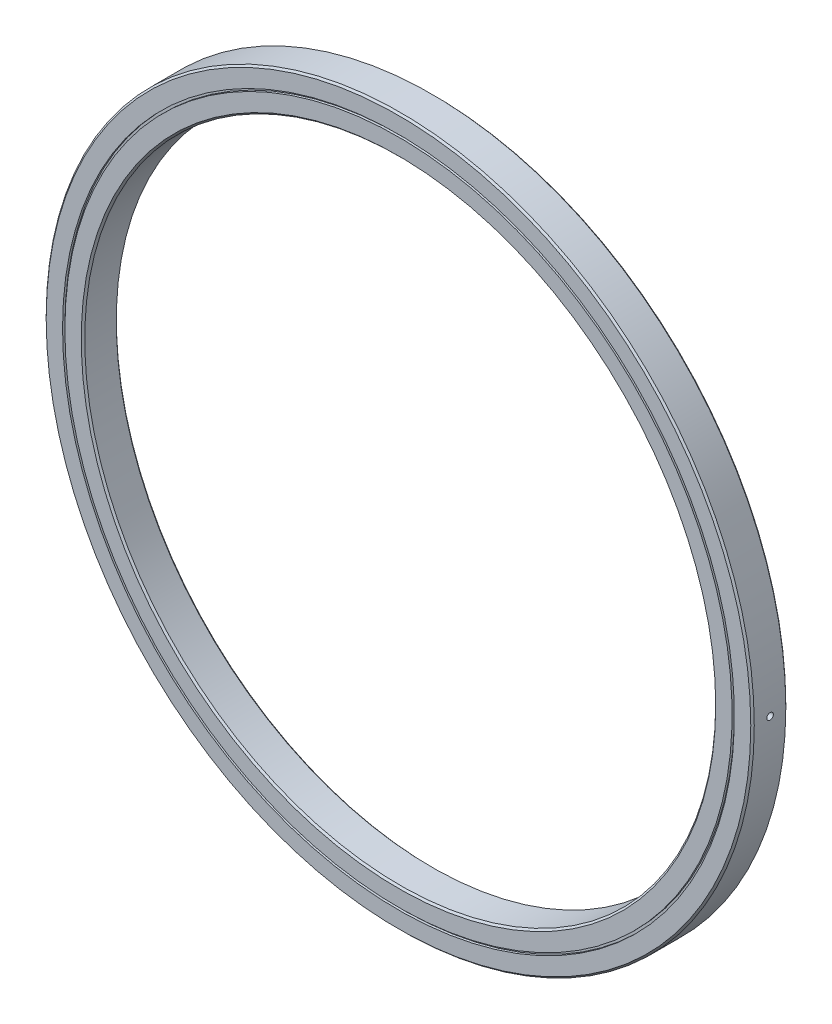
ISO-10303-21;
HEADER;
FILE_DESCRIPTION(('STEP AP214'),'2;1');
FILE_NAME('part.step','',(''),(''),'','','');
FILE_SCHEMA(('AUTOMOTIVE_DESIGN { 1 0 10303 214 1 1 1 1 }'));
ENDSEC;
DATA;
#1=APPLICATION_CONTEXT('core data for automotive mechanical design processes');
#2=APPLICATION_PROTOCOL_DEFINITION('international standard','automotive_design',2000,#1);
#3=PRODUCT_CONTEXT('',#1,'mechanical');
#4=PRODUCT('Part','Part','',(#3));
#5=PRODUCT_RELATED_PRODUCT_CATEGORY('part','',(#4));
#6=PRODUCT_DEFINITION_FORMATION('','',#4);
#7=PRODUCT_DEFINITION_CONTEXT('part definition',#1,'design');
#8=PRODUCT_DEFINITION('design','',#6,#7);
#9=PRODUCT_DEFINITION_SHAPE('','',#8);
#10=(LENGTH_UNIT() NAMED_UNIT(*) SI_UNIT(.MILLI.,.METRE.));
#11=(NAMED_UNIT(*) PLANE_ANGLE_UNIT() SI_UNIT($,.RADIAN.));
#12=(NAMED_UNIT(*) SI_UNIT($,.STERADIAN.) SOLID_ANGLE_UNIT());
#13=UNCERTAINTY_MEASURE_WITH_UNIT(LENGTH_MEASURE(1.E-05),#10,'distance_accuracy_value','');
#14=(GEOMETRIC_REPRESENTATION_CONTEXT(3) GLOBAL_UNCERTAINTY_ASSIGNED_CONTEXT((#13)) GLOBAL_UNIT_ASSIGNED_CONTEXT((#10,
#11,#12)) REPRESENTATION_CONTEXT('',''));
#15=CARTESIAN_POINT('',(0.,0.,0.));
#16=DIRECTION('',(0.,0.,1.));
#17=DIRECTION('',(1.,0.,0.));
#18=AXIS2_PLACEMENT_3D('',#15,#16,#17);
#19=CARTESIAN_POINT('',(0.,0.,-2.5));
#20=DIRECTION('',(0.,0.,1.));
#21=DIRECTION('',(1.,0.,0.));
#22=AXIS2_PLACEMENT_3D('',#19,#20,#21);
#23=PLANE('',#22);
#24=CARTESIAN_POINT('',(0.,0.,-2.49999999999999));
#25=DIRECTION('',(0.,0.,-1.));
#26=DIRECTION('',(-1.,0.,0.));
#27=AXIS2_PLACEMENT_3D('',#24,#25,#26);
#28=CIRCLE('',#27,47.585);
#29=CARTESIAN_POINT('',(-47.585,0.,-2.49999999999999));
#30=VERTEX_POINT('',#29);
#31=EDGE_CURVE('E179',#30,#30,#28,.T.);
#32=ORIENTED_EDGE('',*,*,#31,.T.);
#33=EDGE_LOOP('',(#32));
#34=FACE_BOUND('',#33,.T.);
#35=CARTESIAN_POINT('',(0.,0.,-2.5));
#36=DIRECTION('',(0.,0.,1.));
#37=DIRECTION('',(1.,0.,0.));
#38=AXIS2_PLACEMENT_3D('',#35,#36,#37);
#39=CIRCLE('',#38,45.25);
#40=CARTESIAN_POINT('',(45.25,0.,-2.5));
#41=VERTEX_POINT('',#40);
#42=EDGE_CURVE('E134',#41,#41,#39,.T.);
#43=ORIENTED_EDGE('',*,*,#42,.T.);
#44=EDGE_LOOP('',(#43));
#45=FACE_BOUND('',#44,.T.);
#46=ADVANCED_FACE('F42',(#34,#45),#23,.F.);
#47=CARTESIAN_POINT('',(0.,0.,2.5));
#48=DIRECTION('',(0.,0.,1.));
#49=DIRECTION('',(1.,0.,0.));
#50=AXIS2_PLACEMENT_3D('',#47,#48,#49);
#51=PLANE('',#50);
#52=CARTESIAN_POINT('',(0.,0.,2.5));
#53=DIRECTION('',(0.,0.,-1.));
#54=DIRECTION('',(-1.,0.,0.));
#55=AXIS2_PLACEMENT_3D('',#52,#53,#54);
#56=CIRCLE('',#55,47.585);
#57=CARTESIAN_POINT('',(-47.585,0.,2.5));
#58=VERTEX_POINT('',#57);
#59=EDGE_CURVE('E159',#58,#58,#56,.T.);
#60=ORIENTED_EDGE('',*,*,#59,.F.);
#61=EDGE_LOOP('',(#60));
#62=FACE_BOUND('',#61,.T.);
#63=CARTESIAN_POINT('',(0.,0.,2.5));
#64=DIRECTION('',(0.,0.,1.));
#65=DIRECTION('',(1.,0.,0.));
#66=AXIS2_PLACEMENT_3D('',#63,#64,#65);
#67=CIRCLE('',#66,45.25);
#68=CARTESIAN_POINT('',(45.25,0.,2.5));
#69=VERTEX_POINT('',#68);
#70=EDGE_CURVE('E144',#69,#69,#67,.F.);
#71=ORIENTED_EDGE('',*,*,#70,.T.);
#72=EDGE_LOOP('',(#71));
#73=FACE_BOUND('',#72,.T.);
#74=ADVANCED_FACE('F103',(#62,#73),#51,.T.);
#75=CARTESIAN_POINT('',(0.,0.,-2.5));
#76=DIRECTION('',(0.,0.,1.));
#77=DIRECTION('',(1.,0.,0.));
#78=AXIS2_PLACEMENT_3D('',#75,#76,#77);
#79=CYLINDRICAL_SURFACE('',#78,50.5);
#80=CARTESIAN_POINT('',(-50.5,0.,0.46875));
#81=CARTESIAN_POINT('',(-50.5000000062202,-0.00773466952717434,0.468750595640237));
#82=CARTESIAN_POINT('',(-50.4999982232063,-0.0154697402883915,0.468565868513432));
#83=CARTESIAN_POINT('',(-50.4999911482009,-0.0308657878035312,0.467822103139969));
#84=CARTESIAN_POINT('',(-50.4999858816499,-0.0385268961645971,0.467265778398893));
#85=CARTESIAN_POINT('',(-50.4999719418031,-0.0537751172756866,0.465778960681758));
#86=CARTESIAN_POINT('',(-50.4999632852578,-0.0613624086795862,0.46485030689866));
#87=CARTESIAN_POINT('',(-50.499942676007,-0.0764629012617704,0.462619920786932));
#88=CARTESIAN_POINT('',(-50.4999307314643,-0.0839762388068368,0.461319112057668));
#89=CARTESIAN_POINT('',(-50.499903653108,-0.0989288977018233,0.458345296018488));
#90=CARTESIAN_POINT('',(-50.4998885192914,-0.106368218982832,0.456672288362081));
#91=CARTESIAN_POINT('',(-50.4998551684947,-0.121172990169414,0.452955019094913));
#92=CARTESIAN_POINT('',(-50.499836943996,-0.128538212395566,0.450909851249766));
#93=CARTESIAN_POINT('',(-50.4997975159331,-0.14319504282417,0.44644915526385));
#94=CARTESIAN_POINT('',(-50.4997762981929,-0.150486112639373,0.444031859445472));
#95=CARTESIAN_POINT('',(-50.4997309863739,-0.164994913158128,0.438827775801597));
#96=CARTESIAN_POINT('',(-50.4997068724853,-0.172211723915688,0.436038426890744));
#97=CARTESIAN_POINT('',(-50.4996560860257,-0.186510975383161,0.430116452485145));
#98=CARTESIAN_POINT('',(-50.4996294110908,-0.193593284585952,0.426983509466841));
#99=CARTESIAN_POINT('',(-50.4995739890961,-0.207545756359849,0.420399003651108));
#100=CARTESIAN_POINT('',(-50.499545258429,-0.214417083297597,0.416949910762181));
#101=CARTESIAN_POINT('',(-50.4994859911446,-0.227947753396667,0.409733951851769));
#102=CARTESIAN_POINT('',(-50.4994554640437,-0.23460796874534,0.405968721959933));
#103=CARTESIAN_POINT('',(-50.4993928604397,-0.247716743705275,0.398121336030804));
#104=CARTESIAN_POINT('',(-50.4993607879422,-0.254165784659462,0.394039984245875));
#105=CARTESIAN_POINT('',(-50.4992953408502,-0.266852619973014,0.385561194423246));
#106=CARTESIAN_POINT('',(-50.499261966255,-0.273090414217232,0.381163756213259));
#107=CARTESIAN_POINT('',(-50.4991941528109,-0.285355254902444,0.372053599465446));
#108=CARTESIAN_POINT('',(-50.4991597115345,-0.291381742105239,0.367340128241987));
#109=CARTESIAN_POINT('',(-50.499089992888,-0.303224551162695,0.357598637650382));
#110=CARTESIAN_POINT('',(-50.4990547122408,-0.309039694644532,0.352569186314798));
#111=CARTESIAN_POINT('',(-50.4989835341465,-0.320460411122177,0.342196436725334));
#112=CARTESIAN_POINT('',(-50.4989476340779,-0.326064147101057,0.336851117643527));
#113=CARTESIAN_POINT('',(-50.498875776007,-0.337009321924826,0.325900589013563));
#114=CARTESIAN_POINT('',(-50.4988398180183,-0.34235081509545,0.320295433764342));
#115=CARTESIAN_POINT('',(-50.4987684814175,-0.352715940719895,0.308872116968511));
#116=CARTESIAN_POINT('',(-50.4987331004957,-0.357741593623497,0.303055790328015));
#117=CARTESIAN_POINT('',(-50.4986632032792,-0.367475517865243,0.291210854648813));
#118=CARTESIAN_POINT('',(-50.4986286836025,-0.372185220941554,0.285183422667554));
#119=CARTESIAN_POINT('',(-50.4985607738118,-0.381287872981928,0.272916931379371));
#120=CARTESIAN_POINT('',(-50.4985273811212,-0.385681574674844,0.26667843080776));
#121=CARTESIAN_POINT('',(-50.4984619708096,-0.394152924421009,0.25399042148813));
#122=CARTESIAN_POINT('',(-50.4984299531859,-0.398230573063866,0.247540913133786));
#123=CARTESIAN_POINT('',(-50.4983675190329,-0.406070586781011,0.234431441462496));
#124=CARTESIAN_POINT('',(-50.4983371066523,-0.409832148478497,0.227770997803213));
#125=CARTESIAN_POINT('',(-50.4982780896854,-0.417040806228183,0.214240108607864));
#126=CARTESIAN_POINT('',(-50.4982494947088,-0.420486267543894,0.207368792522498));
#127=CARTESIAN_POINT('',(-50.4981943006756,-0.427063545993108,0.193416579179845));
#128=CARTESIAN_POINT('',(-50.4981677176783,-0.430192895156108,0.186334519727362));
#129=CARTESIAN_POINT('',(-50.4981169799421,-0.436108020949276,0.172035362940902));
#130=CARTESIAN_POINT('',(-50.4980928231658,-0.438894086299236,0.16481838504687));
#131=CARTESIAN_POINT('',(-50.4980473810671,-0.444091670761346,0.150309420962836));
#132=CARTESIAN_POINT('',(-50.4980260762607,-0.44650575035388,0.143018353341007));
#133=CARTESIAN_POINT('',(-50.4979864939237,-0.450960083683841,0.128361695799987));
#134=CARTESIAN_POINT('',(-50.4979682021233,-0.453002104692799,0.120996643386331));
#135=CARTESIAN_POINT('',(-50.4979347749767,-0.456713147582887,0.106192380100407));
#136=CARTESIAN_POINT('',(-50.4979196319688,-0.458383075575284,0.098753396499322));
#137=CARTESIAN_POINT('',(-50.4978926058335,-0.461350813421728,0.0838015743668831));
#138=CARTESIAN_POINT('',(-50.4978807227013,-0.462648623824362,0.076288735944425));
#139=CARTESIAN_POINT('',(-50.4978602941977,-0.464873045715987,0.0611894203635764));
#140=CARTESIAN_POINT('',(-50.4978517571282,-0.465798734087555,0.0536028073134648));
#141=CARTESIAN_POINT('',(-50.4978380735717,-0.467279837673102,0.0383560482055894));
#142=CARTESIAN_POINT('',(-50.4978329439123,-0.467833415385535,0.0306957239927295));
#143=CARTESIAN_POINT('',(-50.4978261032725,-0.468571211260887,0.0153016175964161));
#144=CARTESIAN_POINT('',(-50.4978244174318,-0.468752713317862,0.00756770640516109));
#145=CARTESIAN_POINT('',(-50.4978244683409,-0.46874722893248,-0.00789678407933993));
#146=CARTESIAN_POINT('',(-50.4978262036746,-0.468560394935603,-0.0156273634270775));
#147=CARTESIAN_POINT('',(-50.4978331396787,-0.467812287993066,-0.0310146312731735));
#148=CARTESIAN_POINT('',(-50.4978383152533,-0.467253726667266,-0.0386714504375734));
#149=CARTESIAN_POINT('',(-50.4978520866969,-0.465763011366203,-0.0539110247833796));
#150=CARTESIAN_POINT('',(-50.4978606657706,-0.46483269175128,-0.061493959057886));
#151=CARTESIAN_POINT('',(-50.4978811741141,-0.462599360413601,-0.0765857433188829));
#152=CARTESIAN_POINT('',(-50.4978930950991,-0.461297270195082,-0.0840947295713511));
#153=CARTESIAN_POINT('',(-50.4979201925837,-0.458321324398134,-0.0990386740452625));
#154=CARTESIAN_POINT('',(-50.4979353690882,-0.456647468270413,-0.106473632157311));
#155=CARTESIAN_POINT('',(-50.4979688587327,-0.452928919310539,-0.121269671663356));
#156=CARTESIAN_POINT('',(-50.4979871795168,-0.450883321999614,-0.128630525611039));
#157=CARTESIAN_POINT('',(-50.4980268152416,-0.446422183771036,-0.143278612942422));
#158=CARTESIAN_POINT('',(-50.4980481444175,-0.444004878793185,-0.150565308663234));
#159=CARTESIAN_POINT('',(-50.4980936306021,-0.438801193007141,-0.165065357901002));
#160=CARTESIAN_POINT('',(-50.4981178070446,-0.436012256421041,-0.172277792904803));
#161=CARTESIAN_POINT('',(-50.4981685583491,-0.43009420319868,-0.186561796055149));
#162=CARTESIAN_POINT('',(-50.4981951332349,-0.426965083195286,-0.19363336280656));
#163=CARTESIAN_POINT('',(-50.4982503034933,-0.420389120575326,-0.207565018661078));
#164=CARTESIAN_POINT('',(-50.4982788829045,-0.416944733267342,-0.214426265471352));
#165=CARTESIAN_POINT('',(-50.498337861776,-0.409739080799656,-0.227937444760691));
#166=CARTESIAN_POINT('',(-50.4983682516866,-0.405979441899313,-0.234588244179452));
#167=CARTESIAN_POINT('',(-50.4984306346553,-0.398144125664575,-0.247678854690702));
#168=CARTESIAN_POINT('',(-50.4984626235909,-0.394069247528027,-0.254119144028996));
#169=CARTESIAN_POINT('',(-50.4985279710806,-0.385604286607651,-0.266789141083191));
#170=CARTESIAN_POINT('',(-50.4985613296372,-0.381214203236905,-0.273018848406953));
#171=CARTESIAN_POINT('',(-50.4986291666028,-0.372119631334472,-0.285268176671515));
#172=CARTESIAN_POINT('',(-50.4986636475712,-0.367414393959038,-0.291287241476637));
#173=CARTESIAN_POINT('',(-50.4987334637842,-0.357690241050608,-0.303115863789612));
#174=CARTESIAN_POINT('',(-50.4987688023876,-0.352669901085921,-0.308924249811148));
#175=CARTESIAN_POINT('',(-50.4988400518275,-0.342316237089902,-0.320332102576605));
#176=CARTESIAN_POINT('',(-50.4988759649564,-0.336980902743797,-0.325929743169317));
#177=CARTESIAN_POINT('',(-50.4989477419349,-0.326047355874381,-0.336867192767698));
#178=CARTESIAN_POINT('',(-50.4989836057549,-0.320449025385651,-0.342206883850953));
#179=CARTESIAN_POINT('',(-50.4990547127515,-0.309039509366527,-0.352569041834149));
#180=CARTESIAN_POINT('',(-50.49908995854,-0.303230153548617,-0.357593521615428));
#181=CARTESIAN_POINT('',(-50.4991596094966,-0.291399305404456,-0.367325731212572));
#182=CARTESIAN_POINT('',(-50.4991940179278,-0.285378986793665,-0.372034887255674));
#183=CARTESIAN_POINT('',(-50.499261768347,-0.27312686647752,-0.38113707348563));
#184=CARTESIAN_POINT('',(-50.4992951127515,-0.266895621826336,-0.385530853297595));
#185=CARTESIAN_POINT('',(-50.4993605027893,-0.254222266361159,-0.394002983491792));
#186=CARTESIAN_POINT('',(-50.4993925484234,-0.247780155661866,-0.398081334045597));
#187=CARTESIAN_POINT('',(-50.4994551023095,-0.234685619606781,-0.405923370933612));
#188=CARTESIAN_POINT('',(-50.4994856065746,-0.22803271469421,-0.409686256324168));
#189=CARTESIAN_POINT('',(-50.4995448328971,-0.214517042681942,-0.416898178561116));
#190=CARTESIAN_POINT('',(-50.4995735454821,-0.207653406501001,-0.420345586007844));
#191=CARTESIAN_POINT('',(-50.499628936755,-0.193716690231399,-0.426927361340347));
#192=CARTESIAN_POINT('',(-50.4996555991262,-0.186642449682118,-0.43005926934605));
#193=CARTESIAN_POINT('',(-50.4997064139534,-0.17234633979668,-0.435985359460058));
#194=CARTESIAN_POINT('',(-50.4997305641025,-0.165124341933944,-0.43877923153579));
#195=CARTESIAN_POINT('',(-50.4997759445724,-0.150604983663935,-0.443991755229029));
#196=CARTESIAN_POINT('',(-50.4997971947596,-0.143308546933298,-0.446412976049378));
#197=CARTESIAN_POINT('',(-50.4998366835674,-0.128640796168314,-0.45088091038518));
#198=CARTESIAN_POINT('',(-50.4998549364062,-0.121270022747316,-0.452929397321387));
#199=CARTESIAN_POINT('',(-50.4998883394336,-0.106453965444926,-0.4566526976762));
#200=CARTESIAN_POINT('',(-50.4999034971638,-0.0990089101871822,-0.458328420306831));
#201=CARTESIAN_POINT('',(-50.499930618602,-0.0840446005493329,-0.461307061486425));
#202=CARTESIAN_POINT('',(-50.499942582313,-0.0765253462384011,-0.462609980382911));
#203=CARTESIAN_POINT('',(-50.4999632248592,-0.0614128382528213,-0.464843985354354));
#204=CARTESIAN_POINT('',(-50.4999718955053,-0.0538194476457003,-0.465774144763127));
#205=CARTESIAN_POINT('',(-50.499985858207,-0.0385588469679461,-0.467263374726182));
#206=CARTESIAN_POINT('',(-50.4999911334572,-0.0308914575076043,-0.467820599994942));
#207=CARTESIAN_POINT('',(-50.4999982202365,-0.0154826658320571,-0.468565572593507));
#208=CARTESIAN_POINT('',(-50.500000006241,-0.00774113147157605,-0.468750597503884));
#209=CARTESIAN_POINT('',(-50.5,0.,-0.46875));
#210=B_SPLINE_CURVE_WITH_KNOTS('',3,(#80,#81,#82,#83,#84,#85,#86,#87,#88,#89,#90,#91,#92,#93,
#94,#95,#96,#97,#98,#99,#100,#101,#102,#103,#104,#105,#106,#107,#108,#109,#110,#111,#112,#113,
#114,#115,#116,#117,#118,#119,#120,#121,#122,#123,#124,#125,#126,#127,#128,#129,#130,#131,#132,
#133,#134,#135,#136,#137,#138,#139,#140,#141,#142,#143,#144,#145,#146,#147,#148,#149,#150,#151,
#152,#153,#154,#155,#156,#157,#158,#159,#160,#161,#162,#163,#164,#165,#166,#167,#168,#169,#170,
#171,#172,#173,#174,#175,#176,#177,#178,#179,#180,#181,#182,#183,#184,#185,#186,#187,#188,#189,
#190,#191,#192,#193,#194,#195,#196,#197,#198,#199,#200,#201,#202,#203,#204,#205,#206,#207,#208,
#209),.UNSPECIFIED.,.F.,.F.,(4,2,2,2,2,2,2,2,2,2,2,2,2,2,2,2,2,2,2,2,2,2,2,2,2,2,2,2,2,2,2,2,2,
2,2,2,2,2,2,2,2,2,2,2,2,2,2,2,2,2,2,2,2,2,2,2,2,2,2,2,2,2,2,2,4),(0.,0.0232023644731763,
0.0462371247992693,0.0691594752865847,0.0920254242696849,0.114891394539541,0.137813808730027,
0.16084867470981,0.184051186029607,0.207275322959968,0.230331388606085,0.253274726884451,
0.276161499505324,0.299048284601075,0.321991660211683,0.345047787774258,0.368272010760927,
0.391491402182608,0.414542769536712,0.437481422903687,0.460363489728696,0.483245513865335,
0.506184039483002,0.529235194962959,0.55245429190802,0.575653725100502,0.59868555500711,
0.621604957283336,0.644467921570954,0.667330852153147,0.690250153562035,0.71328181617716,
0.736481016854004,0.759670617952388,0.782692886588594,0.805602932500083,0.828456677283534,
0.851310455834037,0.87422060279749,0.897243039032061,0.920432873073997,0.943622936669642,
0.966645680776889,0.989556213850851,1.01241045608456,1.03526474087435,1.05817540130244,
1.08119835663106,1.10438871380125,1.12758957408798,1.15062283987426,1.17354369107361,
1.19640812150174,1.21927253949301,1.24219335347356,1.26522655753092,1.28842733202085,
1.31164922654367,1.33470306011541,1.35764416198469,1.38052867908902,1.40341317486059,
1.42635421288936,1.44940794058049,1.47262968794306),.UNSPECIFIED.);
#211=CARTESIAN_POINT('',(-50.5,0.,0.46875));
#212=VERTEX_POINT('',#211);
#213=CARTESIAN_POINT('',(-50.5,0.,-0.46875));
#214=VERTEX_POINT('',#213);
#215=EDGE_CURVE('E62',#212,#214,#210,.T.);
#216=ORIENTED_EDGE('',*,*,#215,.T.);
#217=CARTESIAN_POINT('',(-50.5,0.,-0.46875));
#218=CARTESIAN_POINT('',(-50.500000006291,0.00775664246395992,-0.468750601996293));
#219=CARTESIAN_POINT('',(-50.4999982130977,0.0155136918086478,-0.468564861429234));
#220=CARTESIAN_POINT('',(-50.4999910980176,0.0309530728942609,-0.467816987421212));
#221=CARTESIAN_POINT('',(-50.4999858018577,0.0386355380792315,-0.467257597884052));
#222=CARTESIAN_POINT('',(-50.499971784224,0.0539258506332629,-0.465762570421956));
#223=CARTESIAN_POINT('',(-50.4999630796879,0.0615338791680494,-0.464828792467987));
#224=CARTESIAN_POINT('',(-50.4999423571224,0.0766752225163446,-0.462586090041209));
#225=CARTESIAN_POINT('',(-50.4999303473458,0.0842086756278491,-0.461278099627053));
#226=CARTESIAN_POINT('',(-50.4999031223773,0.0992009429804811,-0.45828786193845));
#227=CARTESIAN_POINT('',(-50.4998879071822,0.106659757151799,-0.456605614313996));
#228=CARTESIAN_POINT('',(-50.4998543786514,0.121502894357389,-0.45286781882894));
#229=CARTESIAN_POINT('',(-50.4998360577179,0.128886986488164,-0.450811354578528));
#230=CARTESIAN_POINT('',(-50.4997964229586,0.143580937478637,-0.446326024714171));
#231=CARTESIAN_POINT('',(-50.4997750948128,0.150890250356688,-0.443895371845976));
#232=CARTESIAN_POINT('',(-50.4997295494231,0.165434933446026,-0.438662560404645));
#233=CARTESIAN_POINT('',(-50.4997053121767,0.172669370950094,-0.435857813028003));
#234=CARTESIAN_POINT('',(-50.499654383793,0.18697073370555,-0.429916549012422));
#235=CARTESIAN_POINT('',(-50.4996277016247,0.194038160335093,-0.426781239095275));
#236=CARTESIAN_POINT('',(-50.4995722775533,0.207961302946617,-0.420193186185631));
#237=CARTESIAN_POINT('',(-50.4995435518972,0.214818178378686,-0.416742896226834));
#238=CARTESIAN_POINT('',(-50.4994843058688,0.228320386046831,-0.409525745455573));
#239=CARTESIAN_POINT('',(-50.4994537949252,0.234966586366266,-0.405760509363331));
#240=CARTESIAN_POINT('',(-50.4993912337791,0.248047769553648,-0.397914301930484));
#241=CARTESIAN_POINT('',(-50.4993591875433,0.254483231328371,-0.393834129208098));
#242=CARTESIAN_POINT('',(-50.4992938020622,0.26714334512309,-0.385358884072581));
#243=CARTESIAN_POINT('',(-50.4992604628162,0.273367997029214,-0.380963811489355));
#244=CARTESIAN_POINT('',(-50.4991927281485,0.285606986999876,-0.371859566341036));
#245=CARTESIAN_POINT('',(-50.4991583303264,0.291620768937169,-0.367149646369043));
#246=CARTESIAN_POINT('',(-50.4990887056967,0.303438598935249,-0.357416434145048));
#247=CARTESIAN_POINT('',(-50.4990534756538,0.309241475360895,-0.352391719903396));
#248=CARTESIAN_POINT('',(-50.4989824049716,0.320638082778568,-0.342029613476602));
#249=CARTESIAN_POINT('',(-50.4989465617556,0.326229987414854,-0.336690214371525));
#250=CARTESIAN_POINT('',(-50.4988747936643,0.337156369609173,-0.325748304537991));
#251=CARTESIAN_POINT('',(-50.4988388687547,0.342490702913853,-0.320145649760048));
#252=CARTESIAN_POINT('',(-50.4987676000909,0.352841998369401,-0.308727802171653));
#253=CARTESIAN_POINT('',(-50.4987322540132,0.357860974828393,-0.302914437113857));
#254=CARTESIAN_POINT('',(-50.4986624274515,0.367582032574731,-0.291075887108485));
#255=CARTESIAN_POINT('',(-50.4986279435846,0.372285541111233,-0.285051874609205));
#256=CARTESIAN_POINT('',(-50.4985601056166,0.381376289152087,-0.272792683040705));
#257=CARTESIAN_POINT('',(-50.4985267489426,0.385764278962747,-0.266558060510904));
#258=CARTESIAN_POINT('',(-50.4984614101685,0.394224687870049,-0.253878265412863));
#259=CARTESIAN_POINT('',(-50.4984294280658,0.398297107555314,-0.247433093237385));
#260=CARTESIAN_POINT('',(-50.4983670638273,0.406127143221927,-0.234332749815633));
#261=CARTESIAN_POINT('',(-50.4983366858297,0.409883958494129,-0.227677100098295));
#262=CARTESIAN_POINT('',(-50.4982777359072,0.417083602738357,-0.214156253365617));
#263=CARTESIAN_POINT('',(-50.4982491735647,0.420524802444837,-0.20729018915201));
#264=CARTESIAN_POINT('',(-50.4981940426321,0.427094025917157,-0.193348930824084));
#265=CARTESIAN_POINT('',(-50.4981674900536,0.430219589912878,-0.186272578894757));
#266=CARTESIAN_POINT('',(-50.4981167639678,0.436133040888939,-0.171972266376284));
#267=CARTESIAN_POINT('',(-50.4980925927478,0.438920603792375,-0.16474817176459));
#268=CARTESIAN_POINT('',(-50.4980471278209,0.444120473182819,-0.150224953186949));
#269=CARTESIAN_POINT('',(-50.4980258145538,0.446535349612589,-0.142926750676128));
#270=CARTESIAN_POINT('',(-50.4979862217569,0.450990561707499,-0.128255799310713));
#271=CARTESIAN_POINT('',(-50.4979679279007,0.453032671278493,-0.120883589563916));
#272=CARTESIAN_POINT('',(-50.4979345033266,0.456743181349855,-0.106064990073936));
#273=CARTESIAN_POINT('',(-50.4979193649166,0.458412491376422,-0.098618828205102));
#274=CARTESIAN_POINT('',(-50.4978923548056,0.461378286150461,-0.0836526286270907));
#275=CARTESIAN_POINT('',(-50.4978804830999,0.462674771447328,-0.0761325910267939));
#276=CARTESIAN_POINT('',(-50.4978600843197,0.464895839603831,-0.0610188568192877));
#277=CARTESIAN_POINT('',(-50.4978515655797,0.465819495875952,-0.0534250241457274));
#278=CARTESIAN_POINT('',(-50.4978379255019,0.467295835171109,-0.0381638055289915));
#279=CARTESIAN_POINT('',(-50.4978328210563,0.467846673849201,-0.0304962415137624));
#280=CARTESIAN_POINT('',(-50.4978260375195,0.468578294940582,-0.015087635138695));
#281=CARTESIAN_POINT('',(-50.497824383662,0.468756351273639,-0.00734646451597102));
#282=CARTESIAN_POINT('',(-50.4978245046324,0.468743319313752,0.00813237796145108));
#283=CARTESIAN_POINT('',(-50.4978262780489,0.468552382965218,0.0158700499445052));
#284=CARTESIAN_POINT('',(-50.4978332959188,0.467795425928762,0.0312711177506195));
#285=CARTESIAN_POINT('',(-50.4978385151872,0.467232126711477,0.0389346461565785));
#286=CARTESIAN_POINT('',(-50.4978523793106,0.465731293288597,0.0541872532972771));
#287=CARTESIAN_POINT('',(-50.4978610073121,0.464795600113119,0.0617765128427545));
#288=CARTESIAN_POINT('',(-50.4978816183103,0.462550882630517,0.0768805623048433));
#289=CARTESIAN_POINT('',(-50.4978935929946,0.461242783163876,0.0843954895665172));
#290=CARTESIAN_POINT('',(-50.4979208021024,0.458254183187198,0.0993509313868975));
#291=CARTESIAN_POINT('',(-50.4979360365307,0.456573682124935,0.106791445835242));
#292=CARTESIAN_POINT('',(-50.4979696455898,0.452841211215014,0.121598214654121));
#293=CARTESIAN_POINT('',(-50.4979880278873,0.450788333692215,0.128964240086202));
#294=CARTESIAN_POINT('',(-50.4980277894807,0.44631200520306,0.143622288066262));
#295=CARTESIAN_POINT('',(-50.4980491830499,0.443886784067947,0.150913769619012));
#296=CARTESIAN_POINT('',(-50.4980948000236,0.438666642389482,0.165423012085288));
#297=CARTESIAN_POINT('',(-50.4981190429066,0.435869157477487,0.172639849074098));
#298=CARTESIAN_POINT('',(-50.4981699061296,0.429935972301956,0.186926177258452));
#299=CARTESIAN_POINT('',(-50.4981965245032,0.426800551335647,0.193995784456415));
#300=CARTESIAN_POINT('',(-50.4982517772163,0.420212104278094,0.207923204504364));
#301=CARTESIAN_POINT('',(-50.4982803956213,0.41676153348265,0.2147821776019));
#302=CARTESIAN_POINT('',(-50.4983394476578,0.409543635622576,0.228288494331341));
#303=CARTESIAN_POINT('',(-50.4983698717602,0.405777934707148,0.234936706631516));
#304=CARTESIAN_POINT('',(-50.4984323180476,0.397930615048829,0.248021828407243));
#305=CARTESIAN_POINT('',(-50.4984643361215,0.393849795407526,0.254459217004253));
#306=CARTESIAN_POINT('',(-50.4985297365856,0.385373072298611,0.267123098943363));
#307=CARTESIAN_POINT('',(-50.4985631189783,0.380977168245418,0.273349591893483));
#308=CARTESIAN_POINT('',(-50.498630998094,0.371871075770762,0.285592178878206));
#309=CARTESIAN_POINT('',(-50.4986654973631,0.367160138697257,0.291607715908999));
#310=CARTESIAN_POINT('',(-50.4987353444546,0.35742470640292,0.303428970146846));
#311=CARTESIAN_POINT('',(-50.4987706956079,0.352398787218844,0.309233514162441));
#312=CARTESIAN_POINT('',(-50.4988419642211,0.342034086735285,0.320633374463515));
#313=CARTESIAN_POINT('',(-50.4988778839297,0.336693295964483,0.326226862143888));
#314=CARTESIAN_POINT('',(-50.4989496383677,0.325753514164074,0.337151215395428));
#315=CARTESIAN_POINT('',(-50.4989854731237,0.32015461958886,0.342482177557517));
#316=CARTESIAN_POINT('',(-50.499056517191,0.308744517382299,0.352827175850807));
#317=CARTESIAN_POINT('',(-50.4990917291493,0.302935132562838,0.357843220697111));
#318=CARTESIAN_POINT('',(-50.4991613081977,0.291104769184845,0.367558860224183));
#319=CARTESIAN_POINT('',(-50.499195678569,0.285084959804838,0.37225987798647));
#320=CARTESIAN_POINT('',(-50.4992633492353,0.272834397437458,0.381346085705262));
#321=CARTESIAN_POINT('',(-50.4992966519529,0.266604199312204,0.385732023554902));
#322=CARTESIAN_POINT('',(-50.4993619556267,0.253933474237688,0.394188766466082));
#323=CARTESIAN_POINT('',(-50.4993939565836,0.247492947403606,0.398259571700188));
#324=CARTESIAN_POINT('',(-50.4994564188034,0.234402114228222,0.406086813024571));
#325=CARTESIAN_POINT('',(-50.4994868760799,0.227751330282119,0.409842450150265));
#326=CARTESIAN_POINT('',(-50.4995460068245,0.214240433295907,0.417040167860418));
#327=CARTESIAN_POINT('',(-50.4995746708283,0.207379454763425,0.420480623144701));
#328=CARTESIAN_POINT('',(-50.4996299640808,0.1934485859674,0.427048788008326));
#329=CARTESIAN_POINT('',(-50.4996565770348,0.186377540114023,0.43017404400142));
#330=CARTESIAN_POINT('',(-50.4997072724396,0.172094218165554,0.436084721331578));
#331=CARTESIAN_POINT('',(-50.4997313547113,0.164881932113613,0.438870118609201));
#332=CARTESIAN_POINT('',(-50.4997766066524,0.150382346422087,0.444066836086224));
#333=CARTESIAN_POINT('',(-50.4997977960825,0.14309596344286,0.446480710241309));
#334=CARTESIAN_POINT('',(-50.4998371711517,0.128448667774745,0.450935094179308));
#335=CARTESIAN_POINT('',(-50.4998553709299,0.121088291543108,0.452977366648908));
#336=CARTESIAN_POINT('',(-50.4998886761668,0.106293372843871,0.456689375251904));
#337=CARTESIAN_POINT('',(-50.4999037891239,0.0988590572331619,0.458360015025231));
#338=CARTESIAN_POINT('',(-50.4999308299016,0.0839165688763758,0.461329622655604));
#339=CARTESIAN_POINT('',(-50.4999427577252,0.0764083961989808,0.462628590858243));
#340=CARTESIAN_POINT('',(-50.4999633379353,0.0613183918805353,0.46485582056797));
#341=CARTESIAN_POINT('',(-50.4999719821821,0.0537364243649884,0.465783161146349));
#342=CARTESIAN_POINT('',(-50.4999859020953,0.0384990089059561,0.467267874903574));
#343=CARTESIAN_POINT('',(-50.4999911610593,0.0308433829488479,0.467823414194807));
#344=CARTESIAN_POINT('',(-50.4999982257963,0.0154584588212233,0.468566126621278));
#345=CARTESIAN_POINT('',(-50.5000000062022,0.00772902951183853,0.468750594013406));
#346=CARTESIAN_POINT('',(-50.5,0.,0.46875));
#347=B_SPLINE_CURVE_WITH_KNOTS('',3,(#217,#218,#219,#220,#221,#222,#223,#224,#225,#226,#227,
#228,#229,#230,#231,#232,#233,#234,#235,#236,#237,#238,#239,#240,#241,#242,#243,#244,#245,#246,
#247,#248,#249,#250,#251,#252,#253,#254,#255,#256,#257,#258,#259,#260,#261,#262,#263,#264,#265,
#266,#267,#268,#269,#270,#271,#272,#273,#274,#275,#276,#277,#278,#279,#280,#281,#282,#283,#284,
#285,#286,#287,#288,#289,#290,#291,#292,#293,#294,#295,#296,#297,#298,#299,#300,#301,#302,#303,
#304,#305,#306,#307,#308,#309,#310,#311,#312,#313,#314,#315,#316,#317,#318,#319,#320,#321,#322,
#323,#324,#325,#326,#327,#328,#329,#330,#331,#332,#333,#334,#335,#336,#337,#338,#339,#340,#341,
#342,#343,#344,#345,#346),.UNSPECIFIED.,.F.,.F.,(4,2,2,2,2,2,2,2,2,2,2,2,2,2,2,2,2,2,2,2,2,2,2,
2,2,2,2,2,2,2,2,2,2,2,2,2,2,2,2,2,2,2,2,2,2,2,2,2,2,2,2,2,2,2,2,2,2,2,2,2,2,2,2,2,4),(0.,
0.0232682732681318,0.0463675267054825,0.069353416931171,0.0922824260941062,0.115211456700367,
0.138197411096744,0.161296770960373,0.184565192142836,0.207751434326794,0.230770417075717,
0.253677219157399,0.276527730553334,0.299378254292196,0.322285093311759,0.345304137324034,
0.368490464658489,0.391689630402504,0.414721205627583,0.437640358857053,0.460503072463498,
0.483365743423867,0.506284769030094,0.529316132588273,0.552515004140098,0.575735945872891,
0.598788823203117,0.621728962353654,0.6446125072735,0.667496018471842,0.690436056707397,
0.7134887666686,0.736709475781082,0.759920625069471,0.782963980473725,0.805894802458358,
0.828769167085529,0.851643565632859,0.874574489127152,0.897618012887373,0.920829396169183,
0.944021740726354,0.9670467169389,0.989959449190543,1.01281587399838,1.03567234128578,
1.05858520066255,1.08161038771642,1.10480302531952,1.1279870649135,1.15100386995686,
1.17390850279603,1.19675683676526,1.21960515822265,1.24250975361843,1.26552649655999,
1.28871044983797,1.31189604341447,1.33491435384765,1.35782045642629,1.38067023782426,
1.40351999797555,1.42642603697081,1.44944424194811,1.47262968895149),.UNSPECIFIED.);
#348=EDGE_CURVE('E76',#214,#212,#347,.T.);
#349=ORIENTED_EDGE('',*,*,#348,.T.);
#350=EDGE_LOOP('',(#216,#349));
#351=FACE_BOUND('',#350,.T.);
#352=CARTESIAN_POINT('',(50.5,0.,-0.46875));
#353=CARTESIAN_POINT('',(50.5,0.0051121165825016,-0.46875003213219));
#354=CARTESIAN_POINT('',(50.4999996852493,0.0102242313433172,-0.46866637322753));
#355=CARTESIAN_POINT('',(50.4999984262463,0.020442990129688,-0.468331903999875));
#356=CARTESIAN_POINT('',(50.4999974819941,0.0255496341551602,-0.468081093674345));
#357=CARTESIAN_POINT('',(50.4999949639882,0.035751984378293,-0.46741255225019));
#358=CARTESIAN_POINT('',(50.4999933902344,0.0408476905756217,-0.466994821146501));
#359=CARTESIAN_POINT('',(50.4999896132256,0.0510227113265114,-0.465992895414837));
#360=CARTESIAN_POINT('',(50.4999874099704,0.0561020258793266,-0.465408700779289));
#361=CARTESIAN_POINT('',(50.4999823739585,0.0662388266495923,-0.464074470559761));
#362=CARTESIAN_POINT('',(50.4999795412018,0.0712963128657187,-0.463324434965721));
#363=CARTESIAN_POINT('',(50.4999732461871,0.0813840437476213,-0.461659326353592));
#364=CARTESIAN_POINT('',(50.4999697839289,0.0864142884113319,-0.460744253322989));
#365=CARTESIAN_POINT('',(50.4999622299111,0.0964421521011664,-0.458750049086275));
#366=CARTESIAN_POINT('',(50.4999581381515,0.101439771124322,-0.457670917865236));
#367=CARTESIAN_POINT('',(50.4999493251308,0.111397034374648,-0.455349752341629));
#368=CARTESIAN_POINT('',(50.4999446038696,0.116356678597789,-0.454107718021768));
#369=CARTESIAN_POINT('',(50.499934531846,0.126232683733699,-0.451462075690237));
#370=CARTESIAN_POINT('',(50.4999291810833,0.131149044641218,-0.450058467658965));
#371=CARTESIAN_POINT('',(50.4999178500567,0.140933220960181,-0.447091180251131));
#372=CARTESIAN_POINT('',(50.4999118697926,0.145801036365,-0.445527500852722));
#373=CARTESIAN_POINT('',(50.499899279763,0.155482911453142,-0.442241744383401));
#374=CARTESIAN_POINT('',(50.4998926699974,0.160296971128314,-0.440519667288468));
#375=CARTESIAN_POINT('',(50.4998788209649,0.169866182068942,-0.436918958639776));
#376=CARTESIAN_POINT('',(50.4998715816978,0.174621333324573,-0.435040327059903));
#377=CARTESIAN_POINT('',(50.4998564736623,0.184067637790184,-0.431128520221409));
#378=CARTESIAN_POINT('',(50.4998486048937,0.188758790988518,-0.429095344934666));
#379=CARTESIAN_POINT('',(50.4998322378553,0.198072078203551,-0.424876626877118));
#380=CARTESIAN_POINT('',(50.4998237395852,0.202694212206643,-0.422691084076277));
#381=CARTESIAN_POINT('',(50.4998061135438,0.211864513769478,-0.41816997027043));
#382=CARTESIAN_POINT('',(50.4997969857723,0.216412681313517,-0.415834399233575));
#383=CARTESIAN_POINT('',(50.4997781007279,0.225430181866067,-0.41101572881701));
#384=CARTESIAN_POINT('',(50.4997683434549,0.229899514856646,-0.408532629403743));
#385=CARTESIAN_POINT('',(50.4997481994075,0.238754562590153,-0.403421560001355));
#386=CARTESIAN_POINT('',(50.499737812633,0.243140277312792,-0.400793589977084));
#387=CARTESIAN_POINT('',(50.4997164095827,0.251823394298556,-0.395395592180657));
#388=CARTESIAN_POINT('',(50.4997053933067,0.256120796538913,-0.392625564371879));
#389=CARTESIAN_POINT('',(50.4996827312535,0.264622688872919,-0.386946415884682));
#390=CARTESIAN_POINT('',(50.499671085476,0.268827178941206,-0.384037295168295));
#391=CARTESIAN_POINT('',(50.4996471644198,0.27713874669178,-0.378083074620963));
#392=CARTESIAN_POINT('',(50.4996348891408,0.281245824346,-0.375037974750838));
#393=CARTESIAN_POINT('',(50.4996097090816,0.289358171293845,-0.368815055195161));
#394=CARTESIAN_POINT('',(50.4995968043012,0.293363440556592,-0.365637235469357));
#395=CARTESIAN_POINT('',(50.499570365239,0.301267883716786,-0.359152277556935));
#396=CARTESIAN_POINT('',(50.4995568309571,0.305167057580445,-0.355845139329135));
#397=CARTESIAN_POINT('',(50.499529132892,0.312855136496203,-0.349105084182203));
#398=CARTESIAN_POINT('',(50.4995149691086,0.316644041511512,-0.345672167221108));
#399=CARTESIAN_POINT('',(50.4994860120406,0.324107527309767,-0.338684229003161));
#400=CARTESIAN_POINT('',(50.4994712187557,0.327782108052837,-0.335129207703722));
#401=CARTESIAN_POINT('',(50.4994410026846,0.335013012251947,-0.327900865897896));
#402=CARTESIAN_POINT('',(50.4994255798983,0.338569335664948,-0.324227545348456));
#403=CARTESIAN_POINT('',(50.4993941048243,0.345559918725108,-0.316766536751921));
#404=CARTESIAN_POINT('',(50.4993780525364,0.348994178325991,-0.31297884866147));
#405=CARTESIAN_POINT('',(50.4993453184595,0.355736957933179,-0.305293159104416));
#406=CARTESIAN_POINT('',(50.4993286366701,0.359045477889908,-0.301395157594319));
#407=CARTESIAN_POINT('',(50.4992946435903,0.365533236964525,-0.293493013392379));
#408=CARTESIAN_POINT('',(50.4992773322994,0.368712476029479,-0.289488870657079));
#409=CARTESIAN_POINT('',(50.4992420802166,0.374938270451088,-0.281378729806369));
#410=CARTESIAN_POINT('',(50.4992241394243,0.377984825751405,-0.277272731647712));
#411=CARTESIAN_POINT('',(50.4991876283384,0.383941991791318,-0.268963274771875));
#412=CARTESIAN_POINT('',(50.4991690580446,0.38685260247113,-0.264759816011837));
#413=CARTESIAN_POINT('',(50.4991312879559,0.392534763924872,-0.256259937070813));
#414=CARTESIAN_POINT('',(50.4991120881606,0.395306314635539,-0.251963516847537));
#415=CARTESIAN_POINT('',(50.4990730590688,0.400707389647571,-0.243282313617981));
#416=CARTESIAN_POINT('',(50.4990532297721,0.403336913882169,-0.238897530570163));
#417=CARTESIAN_POINT('',(50.4990129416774,0.408451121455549,-0.230044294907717));
#418=CARTESIAN_POINT('',(50.4989924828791,0.410935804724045,-0.225575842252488));
#419=CARTESIAN_POINT('',(50.4989509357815,0.415757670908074,-0.216560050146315));
#420=CARTESIAN_POINT('',(50.4989298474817,0.418094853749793,-0.212012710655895));
#421=CARTESIAN_POINT('',(50.4988870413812,0.422619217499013,-0.202844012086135));
#422=CARTESIAN_POINT('',(50.4988653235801,0.424806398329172,-0.198222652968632));
#423=CARTESIAN_POINT('',(50.4988212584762,0.429028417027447,-0.188910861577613));
#424=CARTESIAN_POINT('',(50.498798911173,0.431063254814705,-0.184220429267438));
#425=CARTESIAN_POINT('',(50.4987535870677,0.434978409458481,-0.174775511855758));
#426=CARTESIAN_POINT('',(50.4987306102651,0.436858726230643,-0.170021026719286));
#427=CARTESIAN_POINT('',(50.4986840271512,0.440462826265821,-0.160453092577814));
#428=CARTESIAN_POINT('',(50.4986604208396,0.442186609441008,-0.155639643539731));
#429=CARTESIAN_POINT('',(50.4986125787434,0.445475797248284,-0.145958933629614));
#430=CARTESIAN_POINT('',(50.4985883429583,0.447041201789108,-0.141091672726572));
#431=CARTESIAN_POINT('',(50.4985392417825,0.450011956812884,-0.131308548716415));
#432=CARTESIAN_POINT('',(50.4985143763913,0.451417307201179,-0.126392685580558));
#433=CARTESIAN_POINT('',(50.4984640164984,0.454066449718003,-0.116517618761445));
#434=CARTESIAN_POINT('',(50.4984385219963,0.455310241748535,-0.111558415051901));
#435=CARTESIAN_POINT('',(50.4983869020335,0.457634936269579,-0.101601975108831));
#436=CARTESIAN_POINT('',(50.4983607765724,0.458715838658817,-0.0966047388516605));
#437=CARTESIAN_POINT('',(50.4983079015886,0.460713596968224,-0.0865775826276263));
#438=CARTESIAN_POINT('',(50.4982811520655,0.461630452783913,-0.0815476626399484));
#439=CARTESIAN_POINT('',(50.4982270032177,0.463299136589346,-0.0714605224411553));
#440=CARTESIAN_POINT('',(50.4981996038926,0.464050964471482,-0.066403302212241));
#441=CARTESIAN_POINT('',(50.498144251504,0.465388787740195,-0.0562669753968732));
#442=CARTESIAN_POINT('',(50.4981162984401,0.465974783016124,-0.051187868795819));
#443=CARTESIAN_POINT('',(50.498059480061,0.46698031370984,-0.041013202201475));
#444=CARTESIAN_POINT('',(50.4980306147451,0.467399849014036,-0.0359176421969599));
#445=CARTESIAN_POINT('',(50.4979733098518,0.468072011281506,-0.0257155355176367));
#446=CARTESIAN_POINT('',(50.4979448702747,0.468324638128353,-0.0206089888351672));
#447=CARTESIAN_POINT('',(50.4978834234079,0.46866271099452,-0.0103903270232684));
#448=CARTESIAN_POINT('',(50.497850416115,0.468748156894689,-0.00527821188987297));
#449=CARTESIAN_POINT('',(50.497804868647,0.468751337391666,0.0036864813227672));
#450=CARTESIAN_POINT('',(50.4977892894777,0.468705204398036,0.00753907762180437));
#451=CARTESIAN_POINT('',(50.4977651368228,0.468489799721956,0.0164007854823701));
#452=CARTESIAN_POINT('',(50.4977600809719,0.46828765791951,0.0214091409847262));
#453=CARTESIAN_POINT('',(50.4977552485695,0.46765753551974,0.0325740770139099));
#454=CARTESIAN_POINT('',(50.4977569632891,0.467188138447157,0.0387283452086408));
#455=CARTESIAN_POINT('',(50.4977675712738,0.46589577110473,0.0521672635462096));
#456=CARTESIAN_POINT('',(50.4977777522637,0.465022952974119,0.0594471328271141));
#457=CARTESIAN_POINT('',(50.4978052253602,0.462771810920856,0.0751057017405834));
#458=CARTESIAN_POINT('',(50.4978233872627,0.461335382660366,0.0834761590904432));
#459=CARTESIAN_POINT('',(50.4978552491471,0.458756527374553,0.0963894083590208));
#460=CARTESIAN_POINT('',(50.4978672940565,0.457771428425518,0.100964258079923));
#461=CARTESIAN_POINT('',(50.4978933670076,0.455599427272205,0.110364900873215));
#462=CARTESIAN_POINT('',(50.4979074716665,0.454403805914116,0.115188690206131));
#463=CARTESIAN_POINT('',(50.4979376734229,0.451785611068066,0.125075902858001));
#464=CARTESIAN_POINT('',(50.4979538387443,0.45035386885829,0.13013689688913));
#465=CARTESIAN_POINT('',(50.4979881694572,0.447237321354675,0.140485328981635));
#466=CARTESIAN_POINT('',(50.4980063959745,0.44554291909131,0.145769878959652));
#467=CARTESIAN_POINT('',(50.4980448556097,0.441874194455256,0.156549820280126));
#468=CARTESIAN_POINT('',(50.49806514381,0.439889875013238,0.162041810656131));
#469=CARTESIAN_POINT('',(50.4981077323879,0.435613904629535,0.173218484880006));
#470=CARTESIAN_POINT('',(50.4981300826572,0.433311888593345,0.178899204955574));
#471=CARTESIAN_POINT('',(50.4981768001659,0.42837279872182,0.190432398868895));
#472=CARTESIAN_POINT('',(50.4982012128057,0.425725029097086,0.196280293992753));
#473=CARTESIAN_POINT('',(50.4982520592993,0.420066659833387,0.208123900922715));
#474=CARTESIAN_POINT('',(50.4982785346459,0.417045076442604,0.214114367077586));
#475=CARTESIAN_POINT('',(50.4983335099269,0.410611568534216,0.22621597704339));
#476=CARTESIAN_POINT('',(50.4983620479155,0.407188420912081,0.232321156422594));
#477=CARTESIAN_POINT('',(50.4984211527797,0.399924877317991,0.244621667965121));
#478=CARTESIAN_POINT('',(50.4984517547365,0.39607307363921,0.250810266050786));
#479=CARTESIAN_POINT('',(50.498514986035,0.387926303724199,0.263243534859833));
#480=CARTESIAN_POINT('',(50.4985476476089,0.38361980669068,0.269480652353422));
#481=CARTESIAN_POINT('',(50.498615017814,0.374539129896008,0.281973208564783));
#482=CARTESIAN_POINT('',(50.498649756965,0.369753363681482,0.288220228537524));
#483=CARTESIAN_POINT('',(50.4987212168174,0.359691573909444,0.300690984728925));
#484=CARTESIAN_POINT('',(50.4987579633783,0.354403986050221,0.306905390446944));
#485=CARTESIAN_POINT('',(50.4988337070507,0.343318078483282,0.319265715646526));
#486=CARTESIAN_POINT('',(50.4988727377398,0.337508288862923,0.325401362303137));
#487=CARTESIAN_POINT('',(50.4989414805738,0.32697376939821,0.335941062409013));
#488=CARTESIAN_POINT('',(50.4989712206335,0.322316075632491,0.340412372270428));
#489=CARTESIAN_POINT('',(50.4990292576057,0.312905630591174,0.349079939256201));
#490=CARTESIAN_POINT('',(50.499057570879,0.308156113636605,0.353279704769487));
#491=CARTESIAN_POINT('',(50.4991129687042,0.298579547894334,0.361407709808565));
#492=CARTESIAN_POINT('',(50.4991400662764,0.2937555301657,0.365339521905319));
#493=CARTESIAN_POINT('',(50.4991929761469,0.284046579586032,0.372936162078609));
#494=CARTESIAN_POINT('',(50.4992188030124,0.279164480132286,0.376604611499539));
#495=CARTESIAN_POINT('',(50.4992691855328,0.269355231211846,0.383679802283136));
#496=CARTESIAN_POINT('',(50.4992937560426,0.264430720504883,0.387090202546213));
#497=CARTESIAN_POINT('',(50.4993416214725,0.25455170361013,0.39365527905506));
#498=CARTESIAN_POINT('',(50.499364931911,0.249599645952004,0.396813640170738));
#499=CARTESIAN_POINT('',(50.4994102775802,0.239679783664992,0.402881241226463));
#500=CARTESIAN_POINT('',(50.4994323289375,0.234714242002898,0.40579418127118));
#501=CARTESIAN_POINT('',(50.4994751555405,0.224780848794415,0.411378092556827));
#502=CARTESIAN_POINT('',(50.4994959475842,0.219815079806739,0.414052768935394));
#503=CARTESIAN_POINT('',(50.4995362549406,0.209893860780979,0.419167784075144));
#504=CARTESIAN_POINT('',(50.4995557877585,0.204940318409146,0.421611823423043));
#505=CARTESIAN_POINT('',(50.4995935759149,0.195055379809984,0.426273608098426));
#506=CARTESIAN_POINT('',(50.4996118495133,0.190125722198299,0.42849504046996));
#507=CARTESIAN_POINT('',(50.499647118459,0.180299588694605,0.432720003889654));
#508=CARTESIAN_POINT('',(50.4996641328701,0.175404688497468,0.43472720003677));
#509=CARTESIAN_POINT('',(50.4996968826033,0.16565832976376,0.438532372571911));
#510=CARTESIAN_POINT('',(50.4997126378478,0.160808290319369,0.440333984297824));
#511=CARTESIAN_POINT('',(50.4997428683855,0.151161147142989,0.443736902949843));
#512=CARTESIAN_POINT('',(50.4997573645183,0.146365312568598,0.445341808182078));
#513=CARTESIAN_POINT('',(50.499785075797,0.136835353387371,0.448360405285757));
#514=CARTESIAN_POINT('',(50.4997983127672,0.13210235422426,0.449777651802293));
#515=CARTESIAN_POINT('',(50.4998235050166,0.122706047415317,0.452430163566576));
#516=CARTESIAN_POINT('',(50.4998354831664,0.118043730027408,0.453668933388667));
#517=CARTESIAN_POINT('',(50.4998581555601,0.10879634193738,0.45597376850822));
#518=CARTESIAN_POINT('',(50.4998688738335,0.104212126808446,0.457043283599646));
#519=CARTESIAN_POINT('',(50.499898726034,0.090756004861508,0.459969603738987));
#520=CARTESIAN_POINT('',(50.4999164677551,0.0818425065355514,0.461638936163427));
#521=CARTESIAN_POINT('',(50.4999466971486,0.0643949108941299,0.464385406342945));
#522=CARTESIAN_POINT('',(50.499959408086,0.0558648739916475,0.465488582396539));
#523=CARTESIAN_POINT('',(50.4999795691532,0.0392207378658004,0.467177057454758));
#524=CARTESIAN_POINT('',(50.4999872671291,0.0311091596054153,0.467787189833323));
#525=CARTESIAN_POINT('',(50.499997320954,0.0153309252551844,0.468561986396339));
#526=CARTESIAN_POINT('',(50.4999999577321,0.00766541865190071,0.468750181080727));
#527=CARTESIAN_POINT('',(50.5,4.05150031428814E-13,0.46875));
#528=B_SPLINE_CURVE_WITH_KNOTS('',3,(#352,#353,#354,#355,#356,#357,#358,#359,#360,#361,#362,
#363,#364,#365,#366,#367,#368,#369,#370,#371,#372,#373,#374,#375,#376,#377,#378,#379,#380,#381,
#382,#383,#384,#385,#386,#387,#388,#389,#390,#391,#392,#393,#394,#395,#396,#397,#398,#399,#400,
#401,#402,#403,#404,#405,#406,#407,#408,#409,#410,#411,#412,#413,#414,#415,#416,#417,#418,#419,
#420,#421,#422,#423,#424,#425,#426,#427,#428,#429,#430,#431,#432,#433,#434,#435,#436,#437,#438,
#439,#440,#441,#442,#443,#444,#445,#446,#447,#448,#449,#450,#451,#452,#453,#454,#455,#456,#457,
#458,#459,#460,#461,#462,#463,#464,#465,#466,#467,#468,#469,#470,#471,#472,#473,#474,#475,#476,
#477,#478,#479,#480,#481,#482,#483,#484,#485,#486,#487,#488,#489,#490,#491,#492,#493,#494,#495,
#496,#497,#498,#499,#500,#501,#502,#503,#504,#505,#506,#507,#508,#509,#510,#511,#512,#513,#514,
#515,#516,#517,#518,#519,#520,#521,#522,#523,#524,#525,#526,#527),.UNSPECIFIED.,.F.,.F.,(4,2,2,
2,2,2,2,2,2,2,2,2,2,2,2,2,2,2,2,2,2,2,2,2,2,2,2,2,2,2,2,2,2,2,2,2,2,2,2,2,2,2,2,2,2,2,2,2,2,2,2,
2,2,2,2,2,2,2,2,2,2,2,2,2,2,2,2,2,2,2,2,2,2,2,2,2,2,2,2,2,2,2,2,2,2,2,2,4),(0.,
0.0153356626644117,0.0306713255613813,0.0460069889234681,0.061342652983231,0.0766783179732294,
0.0920139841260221,0.107349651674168,0.122685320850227,0.138020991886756,0.153356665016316,
0.168692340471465,0.184028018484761,0.199363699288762,0.214699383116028,0.230035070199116,
0.245370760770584,0.260706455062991,0.276042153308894,0.29137785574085,0.306713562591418,
0.322049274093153,0.337384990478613,0.352720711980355,0.368056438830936,0.383392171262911,
0.398727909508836,0.414063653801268,0.429399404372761,0.444735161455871,0.460070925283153,
0.475406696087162,0.49074247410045,0.506078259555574,0.521414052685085,0.536749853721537,
0.552085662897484,0.567421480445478,0.58275730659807,0.598093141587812,0.613428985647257,
0.628764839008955,0.644100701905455,0.659436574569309,0.674772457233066,0.690108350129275,
0.705444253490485,0.720780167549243,0.736116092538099,0.74767373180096,0.762708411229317,
0.781219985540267,0.803208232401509,0.828672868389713,0.842710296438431,0.857617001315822,
0.873392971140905,0.890038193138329,0.907552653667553,0.925936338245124,0.945189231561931,
0.965311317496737,0.986302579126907,1.00816299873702,1.0308925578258,1.05449123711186,
1.07895901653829,1.10429587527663,1.123660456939,1.14267543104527,1.16134079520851,
1.1796565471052,1.1976226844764,1.21523920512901,1.23250610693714,1.24942338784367,
1.26599104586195,1.28220907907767,1.29807748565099,1.31359626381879,1.32876541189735,
1.34358492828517,1.3580548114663,1.37217506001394,1.39936378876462,1.42515438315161,
1.44954679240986,1.47254097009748),.UNSPECIFIED.);
#529=CARTESIAN_POINT('',(50.5,0.,-0.46875));
#530=VERTEX_POINT('',#529);
#531=CARTESIAN_POINT('',(50.5,0.,0.46875));
#532=VERTEX_POINT('',#531);
#533=EDGE_CURVE('E11',#530,#532,#528,.T.);
#534=ORIENTED_EDGE('',*,*,#533,.F.);
#535=CARTESIAN_POINT('',(50.5,0.,0.46875));
#536=CARTESIAN_POINT('',(50.5,-0.00511053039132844,0.468750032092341));
#537=CARTESIAN_POINT('',(50.4999996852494,-0.0102210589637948,0.468666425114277));
#538=CARTESIAN_POINT('',(50.4999984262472,-0.0204366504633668,0.468332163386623));
#539=CARTESIAN_POINT('',(50.4999974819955,-0.0255417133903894,0.468081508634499));
#540=CARTESIAN_POINT('',(50.4999949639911,-0.0357409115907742,0.467413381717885));
#541=CARTESIAN_POINT('',(50.4999933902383,-0.0408350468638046,0.466995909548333));
#542=CARTESIAN_POINT('',(50.4999896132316,-0.0510069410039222,0.465994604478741));
#543=CARTESIAN_POINT('',(50.4999874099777,-0.0560846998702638,0.465410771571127));
#544=CARTESIAN_POINT('',(50.4999823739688,-0.0662184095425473,0.464077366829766));
#545=CARTESIAN_POINT('',(50.4999795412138,-0.0712743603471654,0.463327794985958));
#546=CARTESIAN_POINT('',(50.4999732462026,-0.0813590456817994,0.461663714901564));
#547=CARTESIAN_POINT('',(50.4999697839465,-0.0863877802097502,0.460749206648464));
#548=CARTESIAN_POINT('',(50.4999622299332,-0.0964126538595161,0.458756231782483));
#549=CARTESIAN_POINT('',(50.4999581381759,-0.101408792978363,0.457677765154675));
#550=CARTESIAN_POINT('',(50.4999493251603,-0.111363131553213,0.455358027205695));
#551=CARTESIAN_POINT('',(50.4999446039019,-0.116321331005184,0.45411675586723));
#552=CARTESIAN_POINT('',(50.4999345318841,-0.126194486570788,0.451472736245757));
#553=CARTESIAN_POINT('',(50.4999291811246,-0.131109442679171,0.450069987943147));
#554=CARTESIAN_POINT('',(50.4999178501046,-0.140890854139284,0.447104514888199));
#555=CARTESIAN_POINT('',(50.499911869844,-0.145757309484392,0.445541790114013));
#556=CARTESIAN_POINT('',(50.4998992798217,-0.155436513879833,0.4422580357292));
#557=CARTESIAN_POINT('',(50.49989267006,-0.160249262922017,0.440537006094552));
#558=CARTESIAN_POINT('',(50.4998788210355,-0.169815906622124,0.436938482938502));
#559=CARTESIAN_POINT('',(50.4998715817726,-0.174569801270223,0.435060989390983));
#560=CARTESIAN_POINT('',(50.4998564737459,-0.184013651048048,0.431151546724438));
#561=CARTESIAN_POINT('',(50.499848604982,-0.188703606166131,0.429119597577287));
#562=CARTESIAN_POINT('',(50.499832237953,-0.198014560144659,0.424903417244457));
#563=CARTESIAN_POINT('',(50.499823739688,-0.2026355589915,0.422719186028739));
#564=CARTESIAN_POINT('',(50.4998061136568,-0.21180365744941,0.418200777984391));
#565=CARTESIAN_POINT('',(50.4997969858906,-0.21635075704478,0.415866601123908));
#566=CARTESIAN_POINT('',(50.4997781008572,-0.22536619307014,0.411050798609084));
#567=CARTESIAN_POINT('',(50.4997683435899,-0.229834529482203,0.408569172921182));
#568=CARTESIAN_POINT('',(50.4997481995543,-0.238687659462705,0.403461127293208));
#569=CARTESIAN_POINT('',(50.4997378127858,-0.24307245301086,0.400834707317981));
#570=CARTESIAN_POINT('',(50.499716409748,-0.251753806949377,0.395439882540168));
#571=CARTESIAN_POINT('',(50.4997053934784,-0.256050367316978,0.392671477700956));
#572=CARTESIAN_POINT('',(50.4996827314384,-0.264550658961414,0.386995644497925));
#573=CARTESIAN_POINT('',(50.4996710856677,-0.268754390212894,0.384088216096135));
#574=CARTESIAN_POINT('',(50.4996471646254,-0.277064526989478,0.378137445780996));
#575=CARTESIAN_POINT('',(50.4996348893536,-0.281170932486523,0.375094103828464));
#576=CARTESIAN_POINT('',(50.4996097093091,-0.289282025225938,0.36887476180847));
#577=CARTESIAN_POINT('',(50.4995968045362,-0.293286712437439,0.365698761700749));
#578=CARTESIAN_POINT('',(50.4995703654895,-0.301190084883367,0.359217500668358));
#579=CARTESIAN_POINT('',(50.4995568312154,-0.305088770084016,0.355912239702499));
#580=CARTESIAN_POINT('',(50.4995291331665,-0.312775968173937,0.349175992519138));
#581=CARTESIAN_POINT('',(50.4995149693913,-0.31656448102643,0.345745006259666));
#582=CARTESIAN_POINT('',(50.4994860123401,-0.324027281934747,0.338760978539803));
#583=CARTESIAN_POINT('',(50.4994712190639,-0.327701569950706,0.335207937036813));
#584=CARTESIAN_POINT('',(50.4994410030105,-0.334931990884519,0.327983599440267));
#585=CARTESIAN_POINT('',(50.4994255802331,-0.338488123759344,0.324312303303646));
#586=CARTESIAN_POINT('',(50.4993941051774,-0.345478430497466,0.316855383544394));
#587=CARTESIAN_POINT('',(50.4993780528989,-0.348912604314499,0.313069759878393));
#588=CARTESIAN_POINT('',(50.4993453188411,-0.355655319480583,0.305388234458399));
#589=CARTESIAN_POINT('',(50.4993286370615,-0.35896386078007,0.3014923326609));
#590=CARTESIAN_POINT('',(50.4992946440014,-0.365451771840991,0.293594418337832));
#591=CARTESIAN_POINT('',(50.4992773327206,-0.368631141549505,0.289592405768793));
#592=CARTESIAN_POINT('',(50.4992420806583,-0.374857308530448,0.281486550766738));
#593=CARTESIAN_POINT('',(50.4992241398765,-0.377904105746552,0.27738270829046));
#594=CARTESIAN_POINT('',(50.4991876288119,-0.383861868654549,0.269077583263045));
#595=CARTESIAN_POINT('',(50.499169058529,-0.38677283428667,0.264876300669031));
#596=CARTESIAN_POINT('',(50.4991312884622,-0.392455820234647,0.256380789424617));
#597=CARTESIAN_POINT('',(50.4991120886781,-0.395227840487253,0.252086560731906));
#598=CARTESIAN_POINT('',(50.4990730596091,-0.400629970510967,0.243409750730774));
#599=CARTESIAN_POINT('',(50.4990532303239,-0.403260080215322,0.239027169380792));
#600=CARTESIAN_POINT('',(50.4990129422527,-0.408375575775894,0.23017834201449));
#601=CARTESIAN_POINT('',(50.4989924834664,-0.410860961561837,0.225712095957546));
#602=CARTESIAN_POINT('',(50.4989509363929,-0.415684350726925,0.216700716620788));
#603=CARTESIAN_POINT('',(50.4989298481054,-0.41802235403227,0.212155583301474));
#604=CARTESIAN_POINT('',(50.4988870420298,-0.422548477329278,0.202991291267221));
#605=CARTESIAN_POINT('',(50.4988653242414,-0.424736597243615,0.198372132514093));
#606=CARTESIAN_POINT('',(50.4988212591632,-0.428960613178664,0.189064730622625));
#607=CARTESIAN_POINT('',(50.4987989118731,-0.430996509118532,0.184376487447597));
#608=CARTESIAN_POINT('',(50.4987535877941,-0.434913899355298,0.174935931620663));
#609=CARTESIAN_POINT('',(50.4987306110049,-0.436795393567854,0.17018361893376));
#610=CARTESIAN_POINT('',(50.4986840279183,-0.440401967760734,0.160620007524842));
#611=CARTESIAN_POINT('',(50.4986604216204,-0.442127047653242,0.155808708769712));
#612=CARTESIAN_POINT('',(50.498612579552,-0.445418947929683,0.146132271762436));
#613=CARTESIAN_POINT('',(50.4985883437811,-0.446985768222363,0.141267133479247));
#614=CARTESIAN_POINT('',(50.498539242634,-0.449959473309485,0.131488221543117));
#615=CARTESIAN_POINT('',(50.4985143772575,-0.45136635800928,0.126574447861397));
#616=CARTESIAN_POINT('',(50.4984640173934,-0.45401868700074,0.116703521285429));
#617=CARTESIAN_POINT('',(50.4984385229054,-0.455264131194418,0.111746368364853));
#618=CARTESIAN_POINT('',(50.4983869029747,-0.457592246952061,0.101793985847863));
#619=CARTESIAN_POINT('',(50.4983607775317,-0.45867491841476,0.0967987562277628));
#620=CARTESIAN_POINT('',(50.4983079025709,-0.460676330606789,0.0867755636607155));
#621=CARTESIAN_POINT('',(50.4982811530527,-0.461595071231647,0.0817476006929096));
#622=CARTESIAN_POINT('',(50.4982270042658,-0.463267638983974,0.0716643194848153));
#623=CARTESIAN_POINT('',(50.4981996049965,-0.464021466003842,0.0666090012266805));
#624=CARTESIAN_POINT('',(50.4981442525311,-0.46536340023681,0.056476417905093));
#625=CARTESIAN_POINT('',(50.4981162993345,-0.465951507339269,0.0513991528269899));
#626=CARTESIAN_POINT('',(50.4980594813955,-0.466961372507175,0.0412281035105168));
#627=CARTESIAN_POINT('',(50.4980306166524,-0.467383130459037,0.0361343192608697));
#628=CARTESIAN_POINT('',(50.4979733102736,-0.468059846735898,0.0259356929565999));
#629=CARTESIAN_POINT('',(50.4979448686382,-0.468314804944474,0.0208308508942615));
#630=CARTESIAN_POINT('',(50.4978834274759,-0.468657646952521,0.0106155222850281));
#631=CARTESIAN_POINT('',(50.4978504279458,-0.468745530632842,0.00550503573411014));
#632=CARTESIAN_POINT('',(50.497804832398,-0.468753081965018,-0.00346268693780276));
#633=CARTESIAN_POINT('',(50.4977892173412,-0.468708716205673,-0.00731992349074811));
#634=CARTESIAN_POINT('',(50.4977649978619,-0.468497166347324,-0.0161901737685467));
#635=CARTESIAN_POINT('',(50.4977599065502,-0.468297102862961,-0.0212024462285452));
#636=CARTESIAN_POINT('',(50.4977550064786,-0.467671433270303,-0.0323745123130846));
#637=CARTESIAN_POINT('',(50.4977566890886,-0.46720441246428,-0.038532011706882));
#638=CARTESIAN_POINT('',(50.4977672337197,-0.465917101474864,-0.0519767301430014));
#639=CARTESIAN_POINT('',(50.4977773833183,-0.465046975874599,-0.0592591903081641));
#640=CARTESIAN_POINT('',(50.4978047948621,-0.462801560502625,-0.0749223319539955));
#641=CARTESIAN_POINT('',(50.4978229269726,-0.46136818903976,-0.0832947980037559));
#642=CARTESIAN_POINT('',(50.4978547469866,-0.458793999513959,-0.0962109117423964));
#643=CARTESIAN_POINT('',(50.4978667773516,-0.457810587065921,-0.100786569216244));
#644=CARTESIAN_POINT('',(50.4978928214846,-0.455642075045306,-0.110188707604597));
#645=CARTESIAN_POINT('',(50.4979069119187,-0.454448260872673,-0.115013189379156));
#646=CARTESIAN_POINT('',(50.4979370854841,-0.451833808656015,-0.124901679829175));
#647=CARTESIAN_POINT('',(50.4979532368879,-0.450404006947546,-0.129963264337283));
#648=CARTESIAN_POINT('',(50.4979875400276,-0.447291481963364,-0.140312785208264));
#649=CARTESIAN_POINT('',(50.4980057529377,-0.445599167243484,-0.145597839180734));
#650=CARTESIAN_POINT('',(50.4980441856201,-0.441934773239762,-0.156378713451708));
#651=CARTESIAN_POINT('',(50.4980644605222,-0.439952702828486,-0.161871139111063));
#652=CARTESIAN_POINT('',(50.498107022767,-0.435681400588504,-0.173048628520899));
#653=CARTESIAN_POINT('',(50.4981293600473,-0.433381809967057,-0.178729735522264));
#654=CARTESIAN_POINT('',(50.4981760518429,-0.428447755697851,-0.190263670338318));
#655=CARTESIAN_POINT('',(50.4982004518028,-0.425802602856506,-0.196111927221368));
#656=CARTESIAN_POINT('',(50.4982512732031,-0.420149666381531,-0.207956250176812));
#657=CARTESIAN_POINT('',(50.4982777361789,-0.417130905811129,-0.213947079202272));
#658=CARTESIAN_POINT('',(50.4983326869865,-0.410703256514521,-0.22604943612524));
#659=CARTESIAN_POINT('',(50.4983612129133,-0.407283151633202,-0.232155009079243));
#660=CARTESIAN_POINT('',(50.4984202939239,-0.400025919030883,-0.244456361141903));
#661=CARTESIAN_POINT('',(50.4984508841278,-0.396177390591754,-0.250645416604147));
#662=CARTESIAN_POINT('',(50.4985140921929,-0.388037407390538,-0.263079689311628));
#663=CARTESIAN_POINT('',(50.4985467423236,-0.383734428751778,-0.269317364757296));
#664=CARTESIAN_POINT('',(50.4986140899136,-0.374661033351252,-0.281811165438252));
#665=CARTESIAN_POINT('',(50.4986488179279,-0.369879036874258,-0.28805888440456));
#666=CARTESIAN_POINT('',(50.4987202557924,-0.359825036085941,-0.300531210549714));
#667=CARTESIAN_POINT('',(50.4987569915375,-0.354541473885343,-0.306746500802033));
#668=CARTESIAN_POINT('',(50.4988327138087,-0.343463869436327,-0.319108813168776));
#669=CARTESIAN_POINT('',(50.4988717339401,-0.337658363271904,-0.325245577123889));
#670=CARTESIAN_POINT('',(50.498940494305,-0.327126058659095,-0.335792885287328));
#671=CARTESIAN_POINT('',(50.4989702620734,-0.322466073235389,-0.34027039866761));
#672=CARTESIAN_POINT('',(50.4990283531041,-0.31305078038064,-0.348949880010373));
#673=CARTESIAN_POINT('',(50.499056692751,-0.30829871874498,-0.353155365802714));
#674=CARTESIAN_POINT('',(50.4991121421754,-0.298716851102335,-0.36129432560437));
#675=CARTESIAN_POINT('',(50.4991392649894,-0.293890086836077,-0.365231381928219));
#676=CARTESIAN_POINT('',(50.4991922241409,-0.28417548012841,-0.372838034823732));
#677=CARTESIAN_POINT('',(50.4992180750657,-0.279290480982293,-0.376511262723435));
#678=CARTESIAN_POINT('',(50.4992685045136,-0.269475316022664,-0.383595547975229));
#679=CARTESIAN_POINT('',(50.4992930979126,-0.26454779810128,-0.387010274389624));
#680=CARTESIAN_POINT('',(50.4993410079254,-0.254662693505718,-0.393583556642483));
#681=CARTESIAN_POINT('',(50.4993643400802,-0.249707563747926,-0.396745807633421));
#682=CARTESIAN_POINT('',(50.4994097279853,-0.239781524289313,-0.402820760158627));
#683=CARTESIAN_POINT('',(50.4994317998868,-0.234812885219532,-0.405737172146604));
#684=CARTESIAN_POINT('',(50.4994746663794,-0.224873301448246,-0.411327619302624));
#685=CARTESIAN_POINT('',(50.4994954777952,-0.219904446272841,-0.414005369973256));
#686=CARTESIAN_POINT('',(50.4995358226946,-0.209977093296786,-0.419126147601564));
#687=CARTESIAN_POINT('',(50.4995553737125,-0.205020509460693,-0.421572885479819));
#688=CARTESIAN_POINT('',(50.4995931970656,-0.195129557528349,-0.426239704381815));
#689=CARTESIAN_POINT('',(50.4996114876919,-0.190196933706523,-0.428463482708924));
#690=CARTESIAN_POINT('',(50.4996467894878,-0.180364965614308,-0.43269279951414));
#691=CARTESIAN_POINT('',(50.499663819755,-0.175467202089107,-0.434702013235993));
#692=CARTESIAN_POINT('',(50.499696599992,-0.165715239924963,-0.438510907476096));
#693=CARTESIAN_POINT('',(50.4997123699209,-0.160862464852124,-0.440314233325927));
#694=CARTESIAN_POINT('',(50.4997426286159,-0.151209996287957,-0.443720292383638));
#695=CARTESIAN_POINT('',(50.4997571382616,-0.146411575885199,-0.445326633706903));
#696=CARTESIAN_POINT('',(50.4997848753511,-0.136876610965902,-0.448347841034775));
#697=CARTESIAN_POINT('',(50.4997981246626,-0.132141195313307,-0.44976627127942));
#698=CARTESIAN_POINT('',(50.4998233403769,-0.122740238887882,-0.452420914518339));
#699=CARTESIAN_POINT('',(50.4998353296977,-0.118075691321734,-0.453660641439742));
#700=CARTESIAN_POINT('',(50.4998580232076,-0.108824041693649,-0.455967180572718));
#701=CARTESIAN_POINT('',(50.499868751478,-0.104237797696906,-0.457037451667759));
#702=CARTESIAN_POINT('',(50.4998986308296,-0.0907762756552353,-0.459965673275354));
#703=CARTESIAN_POINT('',(50.4999163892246,-0.0818593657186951,-0.461636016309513));
#704=CARTESIAN_POINT('',(50.4999466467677,-0.0644058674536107,-0.464383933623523));
#705=CARTESIAN_POINT('',(50.4999593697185,-0.0558733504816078,-0.465487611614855));
#706=CARTESIAN_POINT('',(50.4999795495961,-0.0392252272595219,-0.46717670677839));
#707=CARTESIAN_POINT('',(50.4999872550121,-0.0311121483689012,-0.467787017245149));
#708=CARTESIAN_POINT('',(50.4999973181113,-0.0153319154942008,-0.468561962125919));
#709=CARTESIAN_POINT('',(50.4999999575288,-0.0076659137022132,-0.468750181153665));
#710=CARTESIAN_POINT('',(50.5,0.,-0.46875));
#711=B_SPLINE_CURVE_WITH_KNOTS('',3,(#535,#536,#537,#538,#539,#540,#541,#542,#543,#544,#545,
#546,#547,#548,#549,#550,#551,#552,#553,#554,#555,#556,#557,#558,#559,#560,#561,#562,#563,#564,
#565,#566,#567,#568,#569,#570,#571,#572,#573,#574,#575,#576,#577,#578,#579,#580,#581,#582,#583,
#584,#585,#586,#587,#588,#589,#590,#591,#592,#593,#594,#595,#596,#597,#598,#599,#600,#601,#602,
#603,#604,#605,#606,#607,#608,#609,#610,#611,#612,#613,#614,#615,#616,#617,#618,#619,#620,#621,
#622,#623,#624,#625,#626,#627,#628,#629,#630,#631,#632,#633,#634,#635,#636,#637,#638,#639,#640,
#641,#642,#643,#644,#645,#646,#647,#648,#649,#650,#651,#652,#653,#654,#655,#656,#657,#658,#659,
#660,#661,#662,#663,#664,#665,#666,#667,#668,#669,#670,#671,#672,#673,#674,#675,#676,#677,#678,
#679,#680,#681,#682,#683,#684,#685,#686,#687,#688,#689,#690,#691,#692,#693,#694,#695,#696,#697,
#698,#699,#700,#701,#702,#703,#704,#705,#706,#707,#708,#709,#710),.UNSPECIFIED.,.F.,.F.,(4,2,2,
2,2,2,2,2,2,2,2,2,2,2,2,2,2,2,2,2,2,2,2,2,2,2,2,2,2,2,2,2,2,2,2,2,2,2,2,2,2,2,2,2,2,2,2,2,2,2,2,
2,2,2,2,2,2,2,2,2,2,2,2,2,2,2,2,2,2,2,2,2,2,2,2,2,2,2,2,2,2,2,2,2,2,2,2,4),(0.,
0.0153309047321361,0.0306618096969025,0.0459927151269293,0.0613236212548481,0.07665452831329,
0.0919854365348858,0.107316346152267,0.122647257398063,0.137978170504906,0.153309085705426,
0.168640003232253,0.183970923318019,0.199301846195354,0.214632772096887,0.22996370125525,
0.245294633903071,0.260625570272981,0.27595651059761,0.291287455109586,0.306618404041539,
0.321949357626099,0.337280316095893,0.352611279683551,0.367942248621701,0.383273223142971,
0.39860420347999,0.413935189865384,0.429266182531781,0.444597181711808,0.459928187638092,
0.47525920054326,0.490590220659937,0.505921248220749,0.521252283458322,0.536583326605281,
0.551914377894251,0.567245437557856,0.58257650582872,0.597907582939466,0.613238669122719,
0.6285697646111,0.643900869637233,0.659231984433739,0.674563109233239,0.689894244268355,
0.705225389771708,0.720556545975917,0.735887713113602,0.74745920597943,0.76250537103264,
0.781026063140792,0.80302106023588,0.828490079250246,0.842528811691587,0.857436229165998,
0.873212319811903,0.889857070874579,0.907370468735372,0.925752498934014,0.94500314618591,
0.965122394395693,0.986110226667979,1.00796662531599,1.03069157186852,1.05428504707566,
1.07874703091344,1.10407750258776,1.12345991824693,1.14249196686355,1.16117364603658,
1.17950495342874,1.19748588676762,1.21511644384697,1.23239662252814,1.24932642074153,
1.26590583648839,1.28213486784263,1.29801351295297,1.31354177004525,1.32871963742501,
1.34354711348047,1.3580241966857,1.37215088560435,1.39935021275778,1.42514836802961,
1.44954530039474,1.47254096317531),.UNSPECIFIED.);
#712=EDGE_CURVE('E54',#532,#530,#711,.T.);
#713=ORIENTED_EDGE('',*,*,#712,.F.);
#714=EDGE_LOOP('',(#534,#713));
#715=FACE_BOUND('',#714,.T.);
#716=CARTESIAN_POINT('',(0.,0.,2.25000000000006));
#717=DIRECTION('',(0.,0.,1.));
#718=DIRECTION('',(1.,0.,0.));
#719=AXIS2_PLACEMENT_3D('',#716,#717,#718);
#720=CIRCLE('',#719,50.5);
#721=CARTESIAN_POINT('',(50.5,0.,2.25000000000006));
#722=VERTEX_POINT('',#721);
#723=EDGE_CURVE('E126',#722,#722,#720,.F.);
#724=ORIENTED_EDGE('',*,*,#723,.T.);
#725=EDGE_LOOP('',(#724));
#726=FACE_BOUND('',#725,.T.);
#727=CARTESIAN_POINT('',(0.,0.,-2.25));
#728=DIRECTION('',(0.,0.,1.));
#729=DIRECTION('',(1.,0.,0.));
#730=AXIS2_PLACEMENT_3D('',#727,#728,#729);
#731=CIRCLE('',#730,50.5);
#732=CARTESIAN_POINT('',(50.5,0.,-2.25));
#733=VERTEX_POINT('',#732);
#734=EDGE_CURVE('E129',#733,#733,#731,.T.);
#735=ORIENTED_EDGE('',*,*,#734,.T.);
#736=EDGE_LOOP('',(#735));
#737=FACE_BOUND('',#736,.T.);
#738=ADVANCED_FACE('F85',(#351,#715,#726,#737),#79,.T.);
#739=CARTESIAN_POINT('',(0.,0.,-2.49999999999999));
#740=DIRECTION('',(0.,0.,-1.));
#741=DIRECTION('',(-1.,0.,0.));
#742=AXIS2_PLACEMENT_3D('',#739,#740,#741);
#743=CIRCLE('',#742,47.915);
#744=CARTESIAN_POINT('',(-47.915,0.,-2.49999999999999));
#745=VERTEX_POINT('',#744);
#746=EDGE_CURVE('E183',#745,#745,#743,.T.);
#747=ORIENTED_EDGE('',*,*,#746,.F.);
#748=EDGE_LOOP('',(#747));
#749=FACE_BOUND('',#748,.T.);
#750=CARTESIAN_POINT('',(0.,0.,-2.5));
#751=DIRECTION('',(0.,0.,1.));
#752=DIRECTION('',(1.,0.,0.));
#753=AXIS2_PLACEMENT_3D('',#750,#751,#752);
#754=CIRCLE('',#753,50.25);
#755=CARTESIAN_POINT('',(50.25,0.,-2.5));
#756=VERTEX_POINT('',#755);
#757=EDGE_CURVE('E140',#756,#756,#754,.F.);
#758=ORIENTED_EDGE('',*,*,#757,.T.);
#759=EDGE_LOOP('',(#758));
#760=FACE_BOUND('',#759,.T.);
#761=ADVANCED_FACE('F102',(#749,#760),#23,.F.);
#762=CARTESIAN_POINT('',(0.,0.,-2.5));
#763=DIRECTION('',(0.,0.,1.));
#764=DIRECTION('',(1.,0.,0.));
#765=AXIS2_PLACEMENT_3D('',#762,#763,#764);
#766=CYLINDRICAL_SURFACE('',#765,45.);
#767=CARTESIAN_POINT('',(0.,0.,2.24999999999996));
#768=DIRECTION('',(0.,0.,1.));
#769=DIRECTION('',(1.,0.,0.));
#770=AXIS2_PLACEMENT_3D('',#767,#768,#769);
#771=CIRCLE('',#770,45.);
#772=CARTESIAN_POINT('',(45.,0.,2.24999999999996));
#773=VERTEX_POINT('',#772);
#774=EDGE_CURVE('E151',#773,#773,#771,.T.);
#775=ORIENTED_EDGE('',*,*,#774,.T.);
#776=EDGE_LOOP('',(#775));
#777=FACE_BOUND('',#776,.T.);
#778=CARTESIAN_POINT('',(0.,0.,-2.25000000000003));
#779=DIRECTION('',(0.,0.,1.));
#780=DIRECTION('',(1.,0.,0.));
#781=AXIS2_PLACEMENT_3D('',#778,#779,#780);
#782=CIRCLE('',#781,45.);
#783=CARTESIAN_POINT('',(45.,0.,-2.25000000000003));
#784=VERTEX_POINT('',#783);
#785=EDGE_CURVE('E155',#784,#784,#782,.F.);
#786=ORIENTED_EDGE('',*,*,#785,.T.);
#787=EDGE_LOOP('',(#786));
#788=FACE_BOUND('',#787,.T.);
#789=ADVANCED_FACE('F258',(#777,#788),#766,.F.);
#790=CARTESIAN_POINT('',(0.,0.,2.5));
#791=DIRECTION('',(0.,0.,-1.));
#792=DIRECTION('',(-1.,0.,0.));
#793=AXIS2_PLACEMENT_3D('',#790,#791,#792);
#794=CIRCLE('',#793,47.915);
#795=CARTESIAN_POINT('',(-47.915,0.,2.5));
#796=VERTEX_POINT('',#795);
#797=EDGE_CURVE('E171',#796,#796,#794,.T.);
#798=ORIENTED_EDGE('',*,*,#797,.T.);
#799=EDGE_LOOP('',(#798));
#800=FACE_BOUND('',#799,.T.);
#801=CARTESIAN_POINT('',(0.,0.,2.5));
#802=DIRECTION('',(0.,0.,1.));
#803=DIRECTION('',(1.,0.,0.));
#804=AXIS2_PLACEMENT_3D('',#801,#802,#803);
#805=CIRCLE('',#804,50.25);
#806=CARTESIAN_POINT('',(50.25,0.,2.5));
#807=VERTEX_POINT('',#806);
#808=EDGE_CURVE('E148',#807,#807,#805,.T.);
#809=ORIENTED_EDGE('',*,*,#808,.T.);
#810=EDGE_LOOP('',(#809));
#811=FACE_BOUND('',#810,.T.);
#812=ADVANCED_FACE('F255',(#800,#811),#51,.T.);
#813=CARTESIAN_POINT('',(0.,0.,2.24999999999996));
#814=DIRECTION('',(0.,0.,1.));
#815=DIRECTION('',(1.,0.,0.));
#816=AXIS2_PLACEMENT_3D('',#813,#814,#815);
#817=CONICAL_SURFACE('',#816,45.,0.785398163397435);
#818=ORIENTED_EDGE('',*,*,#70,.F.);
#819=EDGE_LOOP('',(#818));
#820=FACE_BOUND('',#819,.T.);
#821=ORIENTED_EDGE('',*,*,#774,.F.);
#822=EDGE_LOOP('',(#821));
#823=FACE_BOUND('',#822,.T.);
#824=ADVANCED_FACE('F105',(#820,#823),#817,.F.);
#825=CARTESIAN_POINT('',(0.,0.,-2.5));
#826=DIRECTION('',(0.,0.,-1.));
#827=DIRECTION('',(-1.,0.,0.));
#828=AXIS2_PLACEMENT_3D('',#825,#826,#827);
#829=CONICAL_SURFACE('',#828,45.25,0.785398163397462);
#830=ORIENTED_EDGE('',*,*,#785,.F.);
#831=EDGE_LOOP('',(#830));
#832=FACE_BOUND('',#831,.T.);
#833=ORIENTED_EDGE('',*,*,#42,.F.);
#834=EDGE_LOOP('',(#833));
#835=FACE_BOUND('',#834,.T.);
#836=ADVANCED_FACE('F281',(#832,#835),#829,.F.);
#837=CARTESIAN_POINT('',(0.,0.,2.5));
#838=DIRECTION('',(0.,0.,-1.));
#839=DIRECTION('',(-1.,0.,0.));
#840=AXIS2_PLACEMENT_3D('',#837,#838,#839);
#841=CONICAL_SURFACE('',#840,50.25,0.785398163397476);
#842=ORIENTED_EDGE('',*,*,#723,.F.);
#843=EDGE_LOOP('',(#842));
#844=FACE_BOUND('',#843,.T.);
#845=ORIENTED_EDGE('',*,*,#808,.F.);
#846=EDGE_LOOP('',(#845));
#847=FACE_BOUND('',#846,.T.);
#848=ADVANCED_FACE('F271',(#844,#847),#841,.T.);
#849=CARTESIAN_POINT('',(0.,0.,-2.25));
#850=DIRECTION('',(0.,0.,1.));
#851=DIRECTION('',(1.,0.,0.));
#852=AXIS2_PLACEMENT_3D('',#849,#850,#851);
#853=CONICAL_SURFACE('',#852,50.5,0.785398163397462);
#854=ORIENTED_EDGE('',*,*,#757,.F.);
#855=EDGE_LOOP('',(#854));
#856=FACE_BOUND('',#855,.T.);
#857=ORIENTED_EDGE('',*,*,#734,.F.);
#858=EDGE_LOOP('',(#857));
#859=FACE_BOUND('',#858,.T.);
#860=ADVANCED_FACE('F44',(#856,#859),#853,.T.);
#861=CARTESIAN_POINT('',(0.,0.,-2.25));
#862=DIRECTION('',(0.,0.,-1.));
#863=DIRECTION('',(-1.,0.,0.));
#864=AXIS2_PLACEMENT_3D('',#861,#862,#863);
#865=CYLINDRICAL_SURFACE('',#864,47.585);
#866=CARTESIAN_POINT('',(0.,0.,2.17));
#867=DIRECTION('',(0.,0.,-1.));
#868=DIRECTION('',(-1.,0.,0.));
#869=AXIS2_PLACEMENT_3D('',#866,#867,#868);
#870=CIRCLE('',#869,47.585);
#871=CARTESIAN_POINT('',(-47.585,0.,2.17));
#872=VERTEX_POINT('',#871);
#873=EDGE_CURVE('E163',#872,#872,#870,.T.);
#874=ORIENTED_EDGE('',*,*,#873,.F.);
#875=EDGE_LOOP('',(#874));
#876=FACE_BOUND('',#875,.T.);
#877=ORIENTED_EDGE('',*,*,#59,.T.);
#878=EDGE_LOOP('',(#877));
#879=FACE_BOUND('',#878,.T.);
#880=ADVANCED_FACE('F270',(#876,#879),#865,.T.);
#881=CARTESIAN_POINT('',(0.,47.915,2.17));
#882=DIRECTION('',(0.,0.,-1.));
#883=DIRECTION('',(-1.,0.,0.));
#884=AXIS2_PLACEMENT_3D('',#881,#882,#883);
#885=PLANE('',#884);
#886=CARTESIAN_POINT('',(0.,0.,2.17));
#887=DIRECTION('',(0.,0.,-1.));
#888=DIRECTION('',(-1.,0.,0.));
#889=AXIS2_PLACEMENT_3D('',#886,#887,#888);
#890=CIRCLE('',#889,47.915);
#891=CARTESIAN_POINT('',(-47.915,0.,2.17));
#892=VERTEX_POINT('',#891);
#893=EDGE_CURVE('E167',#892,#892,#890,.T.);
#894=ORIENTED_EDGE('',*,*,#893,.F.);
#895=EDGE_LOOP('',(#894));
#896=FACE_BOUND('',#895,.T.);
#897=ORIENTED_EDGE('',*,*,#873,.T.);
#898=EDGE_LOOP('',(#897));
#899=FACE_BOUND('',#898,.T.);
#900=ADVANCED_FACE('F278',(#896,#899),#885,.F.);
#901=CARTESIAN_POINT('',(0.,0.,-2.25));
#902=DIRECTION('',(0.,0.,-1.));
#903=DIRECTION('',(-1.,0.,0.));
#904=AXIS2_PLACEMENT_3D('',#901,#902,#903);
#905=CYLINDRICAL_SURFACE('',#904,47.915);
#906=ORIENTED_EDGE('',*,*,#797,.F.);
#907=EDGE_LOOP('',(#906));
#908=FACE_BOUND('',#907,.T.);
#909=ORIENTED_EDGE('',*,*,#893,.T.);
#910=EDGE_LOOP('',(#909));
#911=FACE_BOUND('',#910,.T.);
#912=ADVANCED_FACE('F299',(#908,#911),#905,.F.);
#913=CARTESIAN_POINT('',(0.,47.915,-2.16999999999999));
#914=DIRECTION('',(0.,0.,1.));
#915=DIRECTION('',(1.,0.,0.));
#916=AXIS2_PLACEMENT_3D('',#913,#914,#915);
#917=PLANE('',#916);
#918=CARTESIAN_POINT('',(0.,0.,-2.16999999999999));
#919=DIRECTION('',(0.,0.,-1.));
#920=DIRECTION('',(-1.,0.,0.));
#921=AXIS2_PLACEMENT_3D('',#918,#919,#920);
#922=CIRCLE('',#921,47.585);
#923=CARTESIAN_POINT('',(-47.585,0.,-2.16999999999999));
#924=VERTEX_POINT('',#923);
#925=EDGE_CURVE('E175',#924,#924,#922,.T.);
#926=ORIENTED_EDGE('',*,*,#925,.F.);
#927=EDGE_LOOP('',(#926));
#928=FACE_BOUND('',#927,.T.);
#929=CARTESIAN_POINT('',(0.,0.,-2.16999999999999));
#930=DIRECTION('',(0.,0.,-1.));
#931=DIRECTION('',(-1.,0.,0.));
#932=AXIS2_PLACEMENT_3D('',#929,#930,#931);
#933=CIRCLE('',#932,47.915);
#934=CARTESIAN_POINT('',(-47.915,0.,-2.16999999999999));
#935=VERTEX_POINT('',#934);
#936=EDGE_CURVE('E187',#935,#935,#933,.T.);
#937=ORIENTED_EDGE('',*,*,#936,.T.);
#938=EDGE_LOOP('',(#937));
#939=FACE_BOUND('',#938,.T.);
#940=ADVANCED_FACE('F303',(#928,#939),#917,.F.);
#941=CARTESIAN_POINT('',(0.,0.,-2.25));
#942=DIRECTION('',(0.,0.,-1.));
#943=DIRECTION('',(-1.,0.,0.));
#944=AXIS2_PLACEMENT_3D('',#941,#942,#943);
#945=CYLINDRICAL_SURFACE('',#944,47.585);
#946=ORIENTED_EDGE('',*,*,#31,.F.);
#947=EDGE_LOOP('',(#946));
#948=FACE_BOUND('',#947,.T.);
#949=ORIENTED_EDGE('',*,*,#925,.T.);
#950=EDGE_LOOP('',(#949));
#951=FACE_BOUND('',#950,.T.);
#952=ADVANCED_FACE('F306',(#948,#951),#945,.T.);
#953=CARTESIAN_POINT('',(0.,0.,-2.25));
#954=DIRECTION('',(0.,0.,-1.));
#955=DIRECTION('',(-1.,0.,0.));
#956=AXIS2_PLACEMENT_3D('',#953,#954,#955);
#957=CYLINDRICAL_SURFACE('',#956,47.915);
#958=ORIENTED_EDGE('',*,*,#936,.F.);
#959=EDGE_LOOP('',(#958));
#960=FACE_BOUND('',#959,.T.);
#961=ORIENTED_EDGE('',*,*,#746,.T.);
#962=EDGE_LOOP('',(#961));
#963=FACE_BOUND('',#962,.T.);
#964=ADVANCED_FACE('F206',(#960,#963),#957,.F.);
#965=CARTESIAN_POINT('',(49.5,0.,0.));
#966=DIRECTION('',(1.,0.,0.));
#967=DIRECTION('',(0.,0.,-1.));
#968=AXIS2_PLACEMENT_3D('',#965,#966,#967);
#969=CYLINDRICAL_SURFACE('',#968,0.46875);
#970=ORIENTED_EDGE('',*,*,#533,.T.);
#971=ORIENTED_EDGE('',*,*,#712,.T.);
#972=EDGE_LOOP('',(#970,#971));
#973=FACE_BOUND('',#972,.T.);
#974=CARTESIAN_POINT('',(49.5,0.,0.));
#975=DIRECTION('',(1.,0.,0.));
#976=DIRECTION('',(0.,0.,-1.));
#977=AXIS2_PLACEMENT_3D('',#974,#975,#976);
#978=CIRCLE('',#977,0.46875);
#979=CARTESIAN_POINT('',(49.5,0.,-0.46875));
#980=VERTEX_POINT('',#979);
#981=EDGE_CURVE('E88',#980,#980,#978,.T.);
#982=ORIENTED_EDGE('',*,*,#981,.F.);
#983=EDGE_LOOP('',(#982));
#984=FACE_BOUND('',#983,.T.);
#985=ADVANCED_FACE('F195',(#973,#984),#969,.F.);
#986=CARTESIAN_POINT('',(49.5,0.,0.));
#987=DIRECTION('',(1.,0.,0.));
#988=DIRECTION('',(0.,0.,-1.));
#989=AXIS2_PLACEMENT_3D('',#986,#987,#988);
#990=PLANE('',#989);
#991=ORIENTED_EDGE('',*,*,#981,.T.);
#992=EDGE_LOOP('',(#991));
#993=FACE_BOUND('',#992,.T.);
#994=ADVANCED_FACE('F205',(#993),#990,.T.);
#995=CARTESIAN_POINT('',(-49.5,0.,0.));
#996=DIRECTION('',(-1.,0.,0.));
#997=DIRECTION('',(0.,0.,-1.));
#998=AXIS2_PLACEMENT_3D('',#995,#996,#997);
#999=CYLINDRICAL_SURFACE('',#998,0.46875);
#1000=ORIENTED_EDGE('',*,*,#348,.F.);
#1001=ORIENTED_EDGE('',*,*,#215,.F.);
#1002=EDGE_LOOP('',(#1000,#1001));
#1003=FACE_BOUND('',#1002,.T.);
#1004=CARTESIAN_POINT('',(-49.5,0.,0.));
#1005=DIRECTION('',(1.,0.,0.));
#1006=DIRECTION('',(0.,0.,-1.));
#1007=AXIS2_PLACEMENT_3D('',#1004,#1005,#1006);
#1008=CIRCLE('',#1007,0.46875);
#1009=CARTESIAN_POINT('',(-49.5,0.,-0.46875));
#1010=VERTEX_POINT('',#1009);
#1011=EDGE_CURVE('E83',#1010,#1010,#1008,.T.);
#1012=ORIENTED_EDGE('',*,*,#1011,.T.);
#1013=EDGE_LOOP('',(#1012));
#1014=FACE_BOUND('',#1013,.T.);
#1015=ADVANCED_FACE('F78',(#1003,#1014),#999,.F.);
#1016=CARTESIAN_POINT('',(-49.5,0.,0.));
#1017=DIRECTION('',(-1.,0.,0.));
#1018=DIRECTION('',(0.,0.,-1.));
#1019=AXIS2_PLACEMENT_3D('',#1016,#1017,#1018);
#1020=PLANE('',#1019);
#1021=ORIENTED_EDGE('',*,*,#1011,.F.);
#1022=EDGE_LOOP('',(#1021));
#1023=FACE_BOUND('',#1022,.T.);
#1024=ADVANCED_FACE('F234',(#1023),#1020,.T.);
#1025=CLOSED_SHELL('',(#46,#74,#738,#761,#789,#812,#824,#836,#848,#860,#880,#900,#912,#940,#952,
#964,#985,#994,#1015,#1024));
#1026=MANIFOLD_SOLID_BREP('B2',#1025);
#1027=ADVANCED_BREP_SHAPE_REPRESENTATION('',(#18,#1026),#14);
#1028=SHAPE_DEFINITION_REPRESENTATION(#9,#1027);
ENDSEC;
END-ISO-10303-21;
